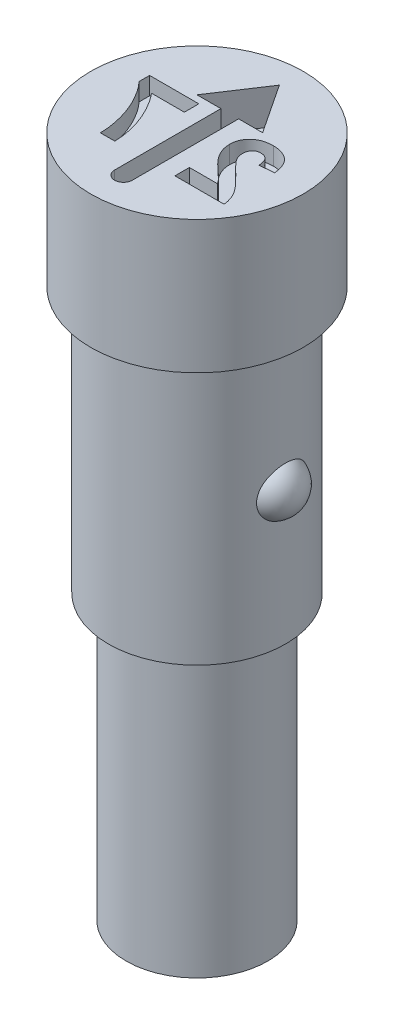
ISO-10303-21;
HEADER;
FILE_DESCRIPTION(('STEP AP214'),'2;1');
FILE_NAME('part.step','',(''),(''),'','','');
FILE_SCHEMA(('AUTOMOTIVE_DESIGN { 1 0 10303 214 1 1 1 1 }'));
ENDSEC;
DATA;
#1=APPLICATION_CONTEXT('core data for automotive mechanical design processes');
#2=APPLICATION_PROTOCOL_DEFINITION('international standard','automotive_design',2000,#1);
#3=PRODUCT_CONTEXT('',#1,'mechanical');
#4=PRODUCT('Part','Part','',(#3));
#5=PRODUCT_RELATED_PRODUCT_CATEGORY('part','',(#4));
#6=PRODUCT_DEFINITION_FORMATION('','',#4);
#7=PRODUCT_DEFINITION_CONTEXT('part definition',#1,'design');
#8=PRODUCT_DEFINITION('design','',#6,#7);
#9=PRODUCT_DEFINITION_SHAPE('','',#8);
#10=(LENGTH_UNIT() NAMED_UNIT(*) SI_UNIT(.MILLI.,.METRE.));
#11=(NAMED_UNIT(*) PLANE_ANGLE_UNIT() SI_UNIT($,.RADIAN.));
#12=(NAMED_UNIT(*) SI_UNIT($,.STERADIAN.) SOLID_ANGLE_UNIT());
#13=UNCERTAINTY_MEASURE_WITH_UNIT(LENGTH_MEASURE(1.E-05),#10,'distance_accuracy_value','');
#14=(GEOMETRIC_REPRESENTATION_CONTEXT(3) GLOBAL_UNCERTAINTY_ASSIGNED_CONTEXT((#13)) GLOBAL_UNIT_ASSIGNED_CONTEXT((#10,
#11,#12)) REPRESENTATION_CONTEXT('',''));
#15=CARTESIAN_POINT('',(0.,0.,0.));
#16=DIRECTION('',(0.,0.,1.));
#17=DIRECTION('',(1.,0.,0.));
#18=AXIS2_PLACEMENT_3D('',#15,#16,#17);
#19=CARTESIAN_POINT('',(0.,0.,0.));
#20=DIRECTION('',(0.,1.,0.));
#21=DIRECTION('',(0.,0.,1.));
#22=AXIS2_PLACEMENT_3D('',#19,#20,#21);
#23=CYLINDRICAL_SURFACE('',#22,1.);
#24=CARTESIAN_POINT('',(0.,-1.5,0.));
#25=DIRECTION('',(0.,1.,0.));
#26=DIRECTION('',(0.,0.,1.));
#27=AXIS2_PLACEMENT_3D('',#24,#25,#26);
#28=CIRCLE('',#27,1.);
#29=CARTESIAN_POINT('',(0.,-1.5,1.));
#30=VERTEX_POINT('',#29);
#31=EDGE_CURVE('E416',#30,#30,#28,.T.);
#32=ORIENTED_EDGE('',*,*,#31,.F.);
#33=EDGE_LOOP('',(#32));
#34=FACE_BOUND('',#33,.T.);
#35=CARTESIAN_POINT('',(0.,-4.5,0.));
#36=DIRECTION('',(0.,1.,0.));
#37=DIRECTION('',(0.,0.,1.));
#38=AXIS2_PLACEMENT_3D('',#35,#36,#37);
#39=CIRCLE('',#38,0.999999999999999);
#40=CARTESIAN_POINT('',(0.,-4.5,0.999999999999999));
#41=VERTEX_POINT('',#40);
#42=EDGE_CURVE('E413',#41,#41,#39,.T.);
#43=ORIENTED_EDGE('',*,*,#42,.T.);
#44=EDGE_LOOP('',(#43));
#45=FACE_BOUND('',#44,.T.);
#46=CARTESIAN_POINT('',(0.958208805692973,-3.,-0.286069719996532));
#47=CARTESIAN_POINT('',(0.95820899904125,-3.01437368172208,-0.286069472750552));
#48=CARTESIAN_POINT('',(0.958569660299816,-3.02875009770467,-0.284869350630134));
#49=CARTESIAN_POINT('',(0.959969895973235,-3.05707616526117,-0.280113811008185));
#50=CARTESIAN_POINT('',(0.961009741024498,-3.07102564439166,-0.276557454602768));
#51=CARTESIAN_POINT('',(0.963645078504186,-3.09807418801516,-0.267229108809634));
#52=CARTESIAN_POINT('',(0.965239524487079,-3.11117479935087,-0.261461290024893));
#53=CARTESIAN_POINT('',(0.968809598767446,-3.1362241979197,-0.247904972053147));
#54=CARTESIAN_POINT('',(0.97078525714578,-3.14817289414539,-0.240116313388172));
#55=CARTESIAN_POINT('',(0.974972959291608,-3.1709720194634,-0.222512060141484));
#56=CARTESIAN_POINT('',(0.977190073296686,-3.18178232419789,-0.212645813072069));
#57=CARTESIAN_POINT('',(0.981589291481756,-3.20169538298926,-0.191313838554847));
#58=CARTESIAN_POINT('',(0.983771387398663,-3.21079773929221,-0.179847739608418));
#59=CARTESIAN_POINT('',(0.98802322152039,-3.22765035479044,-0.154855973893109));
#60=CARTESIAN_POINT('',(0.990077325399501,-3.23527998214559,-0.141246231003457));
#61=CARTESIAN_POINT('',(0.993704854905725,-3.24830068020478,-0.112935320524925));
#62=CARTESIAN_POINT('',(0.995278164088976,-3.25369120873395,-0.0982338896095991));
#63=CARTESIAN_POINT('',(0.997845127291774,-3.26232929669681,-0.0674765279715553));
#64=CARTESIAN_POINT('',(0.99881096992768,-3.26547482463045,-0.0513895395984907));
#65=CARTESIAN_POINT('',(0.999953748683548,-3.26918472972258,-0.0188927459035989));
#66=CARTESIAN_POINT('',(1.00013059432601,-3.26974881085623,-0.00248290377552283));
#67=CARTESIAN_POINT('',(0.999673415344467,-3.26827409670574,0.0304827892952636));
#68=CARTESIAN_POINT('',(0.999025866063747,-3.26619188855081,0.0470365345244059));
#69=CARTESIAN_POINT('',(0.996964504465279,-3.25938391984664,0.0795432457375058));
#70=CARTESIAN_POINT('',(0.995550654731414,-3.25465803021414,0.0954961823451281));
#71=CARTESIAN_POINT('',(0.992111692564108,-3.24265466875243,0.126310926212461));
#72=CARTESIAN_POINT('',(0.990087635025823,-3.23538159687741,0.141174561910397));
#73=CARTESIAN_POINT('',(0.985652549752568,-3.21841700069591,0.169390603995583));
#74=CARTESIAN_POINT('',(0.983241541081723,-3.20872559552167,0.182743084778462));
#75=CARTESIAN_POINT('',(0.978373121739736,-3.18737757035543,0.207215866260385));
#76=CARTESIAN_POINT('',(0.975918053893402,-3.17577127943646,0.21838044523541));
#77=CARTESIAN_POINT('',(0.971206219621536,-3.15071840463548,0.238464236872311));
#78=CARTESIAN_POINT('',(0.96894938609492,-3.1372724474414,0.247384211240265));
#79=CARTESIAN_POINT('',(0.965035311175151,-3.10967534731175,0.262226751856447));
#80=CARTESIAN_POINT('',(0.963352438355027,-3.09560049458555,0.268284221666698));
#81=CARTESIAN_POINT('',(0.960639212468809,-3.06654950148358,0.277844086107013));
#82=CARTESIAN_POINT('',(0.959608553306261,-3.05157378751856,0.281347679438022));
#83=CARTESIAN_POINT('',(0.958375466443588,-3.02217276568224,0.285518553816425));
#84=CARTESIAN_POINT('',(0.958124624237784,-3.00777284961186,0.286351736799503));
#85=CARTESIAN_POINT('',(0.958343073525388,-2.97904115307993,0.285619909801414));
#86=CARTESIAN_POINT('',(0.95881223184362,-2.9647093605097,0.284055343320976));
#87=CARTESIAN_POINT('',(0.960392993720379,-2.9369184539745,0.278662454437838));
#88=CARTESIAN_POINT('',(0.961487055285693,-2.9234462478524,0.274895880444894));
#89=CARTESIAN_POINT('',(0.96418430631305,-2.89732319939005,0.265279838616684));
#90=CARTESIAN_POINT('',(0.965787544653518,-2.88467243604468,0.259430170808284));
#91=CARTESIAN_POINT('',(0.969389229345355,-2.86013951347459,0.245635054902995));
#92=CARTESIAN_POINT('',(0.971397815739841,-2.84829041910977,0.237633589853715));
#93=CARTESIAN_POINT('',(0.975573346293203,-2.82603489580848,0.219863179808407));
#94=CARTESIAN_POINT('',(0.977740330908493,-2.81562883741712,0.210093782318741));
#95=CARTESIAN_POINT('',(0.982155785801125,-2.79587119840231,0.188412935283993));
#96=CARTESIAN_POINT('',(0.984401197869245,-2.7866222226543,0.176407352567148));
#97=CARTESIAN_POINT('',(0.98861092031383,-2.77013639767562,0.151042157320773));
#98=CARTESIAN_POINT('',(0.990575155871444,-2.76290008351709,0.137682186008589));
#99=CARTESIAN_POINT('',(0.994128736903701,-2.75022207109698,0.109200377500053));
#100=CARTESIAN_POINT('',(0.995691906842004,-2.74489927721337,0.0940222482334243));
#101=CARTESIAN_POINT('',(0.998137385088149,-2.73671097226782,0.0629642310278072));
#102=CARTESIAN_POINT('',(0.999019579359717,-2.73384587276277,0.0470842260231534));
#103=CARTESIAN_POINT('',(1.00002899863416,-2.73057384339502,0.0146002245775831));
#104=CARTESIAN_POINT('',(1.00013450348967,-2.73023762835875,-0.00201161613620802));
#105=CARTESIAN_POINT('',(0.999521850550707,-2.73221602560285,-0.0350621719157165));
#106=CARTESIAN_POINT('',(0.998803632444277,-2.73453083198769,-0.0515008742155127));
#107=CARTESIAN_POINT('',(0.996612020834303,-2.74179479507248,-0.083837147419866));
#108=CARTESIAN_POINT('',(0.9951341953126,-2.74675941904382,-0.0997309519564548));
#109=CARTESIAN_POINT('',(0.991580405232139,-2.75924675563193,-0.130410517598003));
#110=CARTESIAN_POINT('',(0.989504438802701,-2.76676947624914,-0.145196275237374));
#111=CARTESIAN_POINT('',(0.985014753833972,-2.78412628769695,-0.173039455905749));
#112=CARTESIAN_POINT('',(0.98260535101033,-2.79393179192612,-0.186115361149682));
#113=CARTESIAN_POINT('',(0.977710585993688,-2.81569757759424,-0.210320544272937));
#114=CARTESIAN_POINT('',(0.975225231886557,-2.82765763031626,-0.221450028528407));
#115=CARTESIAN_POINT('',(0.970582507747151,-2.85292797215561,-0.24097009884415));
#116=CARTESIAN_POINT('',(0.96841606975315,-2.86616643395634,-0.249451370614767));
#117=CARTESIAN_POINT('',(0.964571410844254,-2.89399848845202,-0.263928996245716));
#118=CARTESIAN_POINT('',(0.962892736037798,-2.90859080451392,-0.269927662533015));
#119=CARTESIAN_POINT('',(0.960484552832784,-2.93595137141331,-0.278361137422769));
#120=CARTESIAN_POINT('',(0.959638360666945,-2.94857293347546,-0.281243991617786));
#121=CARTESIAN_POINT('',(0.958500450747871,-2.97412896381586,-0.285098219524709));
#122=CARTESIAN_POINT('',(0.958208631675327,-2.98706337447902,-0.286069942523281));
#123=CARTESIAN_POINT('',(0.958208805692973,-3.,-0.286069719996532));
#124=B_SPLINE_CURVE_WITH_KNOTS('',3,(#46,#47,#48,#49,#50,#51,#52,#53,#54,#55,#56,#57,#58,#59,
#60,#61,#62,#63,#64,#65,#66,#67,#68,#69,#70,#71,#72,#73,#74,#75,#76,#77,#78,#79,#80,#81,#82,#83,
#84,#85,#86,#87,#88,#89,#90,#91,#92,#93,#94,#95,#96,#97,#98,#99,#100,#101,#102,#103,#104,#105,
#106,#107,#108,#109,#110,#111,#112,#113,#114,#115,#116,#117,#118,#119,#120,#121,#122,#123),
.UNSPECIFIED.,.T.,.F.,(4,2,2,2,2,2,2,2,2,2,2,2,2,2,2,2,2,2,2,2,2,2,2,2,2,2,2,2,2,2,2,2,2,2,2,2,
2,2,4),(0.,0.0430722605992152,0.0861616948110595,0.129170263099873,0.172182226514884,
0.216398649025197,0.260625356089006,0.307626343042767,0.354638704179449,0.403671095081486,
0.452709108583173,0.502562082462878,0.552417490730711,0.60218720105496,0.65195446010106,
0.700577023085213,0.749183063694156,0.795186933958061,0.841169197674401,0.884233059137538,
0.927288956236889,0.969191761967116,1.01109859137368,1.05422451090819,1.0973614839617,
1.14312165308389,1.18889397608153,1.23715387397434,1.28542185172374,1.3350346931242,
1.38465116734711,1.43456047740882,1.48446994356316,1.53378516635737,1.58309515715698,
1.63046100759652,1.67778263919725,1.71655569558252,1.75532166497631),.UNSPECIFIED.);
#125=CARTESIAN_POINT('',(0.958208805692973,-3.,-0.286069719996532));
#126=VERTEX_POINT('',#125);
#127=EDGE_CURVE('E41',#126,#126,#124,.T.);
#128=ORIENTED_EDGE('',*,*,#127,.T.);
#129=EDGE_LOOP('',(#128));
#130=FACE_BOUND('',#129,.T.);
#131=ADVANCED_FACE('F37',(#34,#45,#130),#23,.T.);
#132=CARTESIAN_POINT('',(0.,0.,0.));
#133=DIRECTION('',(0.,1.,0.));
#134=DIRECTION('',(0.,0.,1.));
#135=AXIS2_PLACEMENT_3D('',#132,#133,#134);
#136=PLANE('',#135);
#137=DIRECTION('',(-1.,0.,0.));
#138=VECTOR('',#137,1.);
#139=CARTESIAN_POINT('',(0.613104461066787,0.,0.383307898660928));
#140=LINE('',#139,#138);
#141=CARTESIAN_POINT('',(0.613104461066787,0.,0.383307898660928));
#142=VERTEX_POINT('',#141);
#143=CARTESIAN_POINT('',(0.297249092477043,0.,0.383307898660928));
#144=VERTEX_POINT('',#143);
#145=EDGE_CURVE('E58',#142,#144,#140,.T.);
#146=ORIENTED_EDGE('',*,*,#145,.F.);
#147=CARTESIAN_POINT('',(0.379660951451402,0.,0.141180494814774));
#148=CARTESIAN_POINT('',(0.382246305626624,0.,0.144436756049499));
#149=CARTESIAN_POINT('',(0.387783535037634,0.,0.151410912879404));
#150=CARTESIAN_POINT('',(0.397203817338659,0.,0.162104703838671));
#151=CARTESIAN_POINT('',(0.40812111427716,0.,0.173785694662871));
#152=CARTESIAN_POINT('',(0.420381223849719,0.,0.186672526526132));
#153=CARTESIAN_POINT('',(0.434389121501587,0.,0.200308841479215));
#154=CARTESIAN_POINT('',(0.449640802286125,0.,0.215264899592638));
#155=CARTESIAN_POINT('',(0.466807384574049,0.,0.23077564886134));
#156=CARTESIAN_POINT('',(0.484587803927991,0.,0.247228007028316));
#157=CARTESIAN_POINT('',(0.502445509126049,0.,0.263240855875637));
#158=CARTESIAN_POINT('',(0.518859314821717,0.,0.278449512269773));
#159=CARTESIAN_POINT('',(0.533768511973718,0.,0.291905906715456));
#160=CARTESIAN_POINT('',(0.546478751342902,0.,0.304352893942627));
#161=CARTESIAN_POINT('',(0.557737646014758,0.,0.314940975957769));
#162=CARTESIAN_POINT('',(0.567139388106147,0.,0.324213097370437));
#163=CARTESIAN_POINT('',(0.574859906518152,0.,0.331944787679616));
#164=CARTESIAN_POINT('',(0.585498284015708,0.,0.343996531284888));
#165=CARTESIAN_POINT('',(0.599034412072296,0.,0.360296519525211));
#166=CARTESIAN_POINT('',(0.608557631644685,0.,0.375871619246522));
#167=CARTESIAN_POINT('',(0.613104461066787,0.,0.383307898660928));
#168=B_SPLINE_CURVE_WITH_KNOTS('',3,(#147,#148,#149,#150,#151,#152,#153,#154,#155,#156,#157,
#158,#159,#160,#161,#162,#163,#164,#165,#166,#167),.UNSPECIFIED.,.F.,.F.,(4,1,1,1,1,1,1,1,1,1,1,
1,1,1,1,1,1,1,4),(0.,0.0369753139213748,0.0791925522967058,0.126700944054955,0.17918407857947,
0.237368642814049,0.300558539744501,0.369153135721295,0.443112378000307,0.516018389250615,
0.582473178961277,0.642136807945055,0.694619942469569,0.740679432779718,0.779589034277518,
0.812073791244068,0.837814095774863,0.922564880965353,1.),.UNSPECIFIED.);
#169=CARTESIAN_POINT('',(0.379660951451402,0.,0.141180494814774));
#170=VERTEX_POINT('',#169);
#171=EDGE_CURVE('E243',#170,#142,#168,.T.);
#172=ORIENTED_EDGE('',*,*,#171,.F.);
#173=CARTESIAN_POINT('',(0.297249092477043,0.,-0.0720005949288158));
#174=CARTESIAN_POINT('',(0.297457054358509,0.,-0.0627352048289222));
#175=CARTESIAN_POINT('',(0.297869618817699,0.,-0.0443540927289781));
#176=CARTESIAN_POINT('',(0.301819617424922,0.,-0.0171813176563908));
#177=CARTESIAN_POINT('',(0.307854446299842,0.,0.00936485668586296));
#178=CARTESIAN_POINT('',(0.316773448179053,0.,0.0353493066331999));
#179=CARTESIAN_POINT('',(0.328078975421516,0.,0.0613953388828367));
#180=CARTESIAN_POINT('',(0.342652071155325,0.,0.0875614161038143));
#181=CARTESIAN_POINT('',(0.359572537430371,0.,0.114636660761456));
#182=CARTESIAN_POINT('',(0.37282059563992,0.,0.132141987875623));
#183=CARTESIAN_POINT('',(0.379660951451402,0.,0.141180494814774));
#184=B_SPLINE_CURVE_WITH_KNOTS('',3,(#173,#174,#175,#176,#177,#178,#179,#180,#181,#182,#183),
.UNSPECIFIED.,.F.,.F.,(4,1,1,1,1,1,1,1,4),(0.,0.119176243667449,0.236427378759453,
0.352663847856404,0.469086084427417,0.589462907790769,0.717601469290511,0.854189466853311,1.),.UNSPECIFIED.);
#185=CARTESIAN_POINT('',(0.297249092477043,0.,-0.0720005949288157));
#186=VERTEX_POINT('',#185);
#187=EDGE_CURVE('E246',#186,#170,#184,.T.);
#188=ORIENTED_EDGE('',*,*,#187,.F.);
#189=CARTESIAN_POINT('',(0.558106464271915,0.,-0.303230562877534));
#190=CARTESIAN_POINT('',(0.548223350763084,0.,-0.303040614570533));
#191=CARTESIAN_POINT('',(0.528974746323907,0.,-0.302670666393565));
#192=CARTESIAN_POINT('',(0.500875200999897,0.,-0.299615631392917));
#193=CARTESIAN_POINT('',(0.474477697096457,0.,-0.294288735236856));
#194=CARTESIAN_POINT('',(0.449551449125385,0.,-0.287232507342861));
#195=CARTESIAN_POINT('',(0.426352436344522,0.,-0.277811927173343));
#196=CARTESIAN_POINT('',(0.404687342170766,0.,-0.266422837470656));
#197=CARTESIAN_POINT('',(0.384897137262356,0.,-0.25263299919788));
#198=CARTESIAN_POINT('',(0.366686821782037,0.,-0.23719443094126));
#199=CARTESIAN_POINT('',(0.350408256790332,0.,-0.220217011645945));
#200=CARTESIAN_POINT('',(0.336149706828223,0.,-0.202107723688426));
#201=CARTESIAN_POINT('',(0.324203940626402,0.,-0.182879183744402));
#202=CARTESIAN_POINT('',(0.314179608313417,0.,-0.162765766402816));
#203=CARTESIAN_POINT('',(0.306736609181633,0.,-0.141443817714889));
#204=CARTESIAN_POINT('',(0.30131331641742,0.,-0.119208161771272));
#205=CARTESIAN_POINT('',(0.297717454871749,0.,-0.095955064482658));
#206=CARTESIAN_POINT('',(0.29740693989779,0.,-0.0800737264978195));
#207=CARTESIAN_POINT('',(0.297249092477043,0.,-0.0720005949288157));
#208=B_SPLINE_CURVE_WITH_KNOTS('',3,(#189,#190,#191,#192,#193,#194,#195,#196,#197,#198,#199,
#200,#201,#202,#203,#204,#205,#206,#207),.UNSPECIFIED.,.F.,.F.,(4,1,1,1,1,1,1,1,1,1,1,1,1,1,1,1,
4),(0.,0.0756723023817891,0.147381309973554,0.216084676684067,0.28169803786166,
0.345459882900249,0.407485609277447,0.46873129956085,0.529782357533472,0.590032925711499,
0.648548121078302,0.70595351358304,0.763101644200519,0.820289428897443,0.878479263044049,
0.938226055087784,1.),.UNSPECIFIED.);
#209=CARTESIAN_POINT('',(0.558106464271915,0.,-0.303230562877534));
#210=VERTEX_POINT('',#209);
#211=EDGE_CURVE('E552',#210,#186,#208,.T.);
#212=ORIENTED_EDGE('',*,*,#211,.F.);
#213=CARTESIAN_POINT('',(0.831223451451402,0.,-0.0468002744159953));
#214=CARTESIAN_POINT('',(0.829909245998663,0.,-0.0578359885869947));
#215=CARTESIAN_POINT('',(0.827361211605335,0.,-0.0792324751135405));
#216=CARTESIAN_POINT('',(0.821002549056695,0.,-0.109965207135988));
#217=CARTESIAN_POINT('',(0.81294953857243,0.,-0.138317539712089));
#218=CARTESIAN_POINT('',(0.802818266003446,0.,-0.164236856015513));
#219=CARTESIAN_POINT('',(0.791027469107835,0.,-0.187887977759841));
#220=CARTESIAN_POINT('',(0.776975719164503,0.,-0.208916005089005));
#221=CARTESIAN_POINT('',(0.76115399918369,0.,-0.227553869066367));
#222=CARTESIAN_POINT('',(0.743548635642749,0.,-0.243791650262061));
#223=CARTESIAN_POINT('',(0.724271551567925,0.,-0.257681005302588));
#224=CARTESIAN_POINT('',(0.704043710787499,0.,-0.270079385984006));
#225=CARTESIAN_POINT('',(0.682469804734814,0.,-0.280249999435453));
#226=CARTESIAN_POINT('',(0.65978736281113,0.,-0.288632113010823));
#227=CARTESIAN_POINT('',(0.63600663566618,0.,-0.295331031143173));
#228=CARTESIAN_POINT('',(0.611017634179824,0.,-0.299760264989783));
#229=CARTESIAN_POINT('',(0.584974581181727,0.,-0.302875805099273));
#230=CARTESIAN_POINT('',(0.567197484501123,0.,-0.30311052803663));
#231=CARTESIAN_POINT('',(0.558106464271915,0.,-0.303230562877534));
#232=B_SPLINE_CURVE_WITH_KNOTS('',3,(#213,#214,#215,#216,#217,#218,#219,#220,#221,#222,#223,
#224,#225,#226,#227,#228,#229,#230,#231),.UNSPECIFIED.,.F.,.F.,(4,1,1,1,1,1,1,1,1,1,1,1,1,1,1,1,
4),(0.,0.0794357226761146,0.154013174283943,0.224141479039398,0.289934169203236,
0.352732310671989,0.41272577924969,0.470302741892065,0.527168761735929,0.583502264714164,
0.639948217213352,0.696584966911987,0.753726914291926,0.812707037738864,0.872963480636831,
0.93503486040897,1.),.UNSPECIFIED.);
#233=CARTESIAN_POINT('',(0.831223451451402,0.,-0.0468002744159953));
#234=VERTEX_POINT('',#233);
#235=EDGE_CURVE('E560',#234,#210,#232,.T.);
#236=ORIENTED_EDGE('',*,*,#235,.F.);
#237=DIRECTION('',(0.995240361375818,0.,-0.0974506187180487));
#238=VECTOR('',#237,1.);
#239=CARTESIAN_POINT('',(0.667761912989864,0.,-0.0307946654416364));
#240=LINE('',#239,#238);
#241=CARTESIAN_POINT('',(0.667761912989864,0.,-0.0307946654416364));
#242=VERTEX_POINT('',#241);
#243=EDGE_CURVE('E568',#242,#234,#240,.T.);
#244=ORIENTED_EDGE('',*,*,#243,.F.);
#245=CARTESIAN_POINT('',(0.561511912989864,0.,-0.161563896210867));
#246=CARTESIAN_POINT('',(0.568925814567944,0.,-0.161228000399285));
#247=CARTESIAN_POINT('',(0.583247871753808,0.,-0.160579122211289));
#248=CARTESIAN_POINT('',(0.603602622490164,0.,-0.154910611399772));
#249=CARTESIAN_POINT('',(0.621409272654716,0.,-0.145097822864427));
#250=CARTESIAN_POINT('',(0.634099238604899,0.,-0.133915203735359));
#251=CARTESIAN_POINT('',(0.642671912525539,0.,-0.123040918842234));
#252=CARTESIAN_POINT('',(0.64851303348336,0.,-0.113564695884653));
#253=CARTESIAN_POINT('',(0.653547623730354,0.,-0.102796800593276));
#254=CARTESIAN_POINT('',(0.658008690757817,0.,-0.090858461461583));
#255=CARTESIAN_POINT('',(0.661532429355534,0.,-0.0776129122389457));
#256=CARTESIAN_POINT('',(0.664370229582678,0.,-0.0631610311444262));
#257=CARTESIAN_POINT('',(0.666657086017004,0.,-0.0474250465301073));
#258=CARTESIAN_POINT('',(0.667384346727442,0.,-0.0364779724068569));
#259=CARTESIAN_POINT('',(0.667761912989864,0.,-0.0307946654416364));
#260=B_SPLINE_CURVE_WITH_KNOTS('',3,(#245,#246,#247,#248,#249,#250,#251,#252,#253,#254,#255,
#256,#257,#258,#259),.UNSPECIFIED.,.F.,.F.,(4,1,1,1,1,1,1,1,1,1,1,1,4),(0.,0.116899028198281,
0.225823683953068,0.330086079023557,0.435451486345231,0.490306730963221,0.548244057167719,
0.610766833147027,0.677675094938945,0.749188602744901,0.826858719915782,0.910111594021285,1.),.UNSPECIFIED.);
#261=CARTESIAN_POINT('',(0.561511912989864,0.,-0.161563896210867));
#262=VERTEX_POINT('',#261);
#263=EDGE_CURVE('E574',#262,#242,#260,.T.);
#264=ORIENTED_EDGE('',*,*,#263,.F.);
#265=CARTESIAN_POINT('',(0.460710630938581,0.,-0.0500354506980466));
#266=CARTESIAN_POINT('',(0.461016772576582,0.,-0.0585162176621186));
#267=CARTESIAN_POINT('',(0.461595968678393,0.,-0.0745611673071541));
#268=CARTESIAN_POINT('',(0.466452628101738,0.,-0.0972035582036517));
#269=CARTESIAN_POINT('',(0.475065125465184,0.,-0.1166679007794));
#270=CARTESIAN_POINT('',(0.48692294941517,0.,-0.133013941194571));
#271=CARTESIAN_POINT('',(0.501917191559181,0.,-0.145821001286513));
#272=CARTESIAN_POINT('',(0.519445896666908,0.,-0.155284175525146));
#273=CARTESIAN_POINT('',(0.539765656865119,0.,-0.1605160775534));
#274=CARTESIAN_POINT('',(0.554047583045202,0.,-0.161204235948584));
#275=CARTESIAN_POINT('',(0.561511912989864,0.,-0.161563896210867));
#276=B_SPLINE_CURVE_WITH_KNOTS('',3,(#265,#266,#267,#268,#269,#270,#271,#272,#273,#274,#275),
.UNSPECIFIED.,.F.,.F.,(4,1,1,1,1,1,1,1,4),(0.,0.149140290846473,0.282161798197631,
0.404655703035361,0.521109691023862,0.63441645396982,0.748796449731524,0.868710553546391,1.),.UNSPECIFIED.);
#277=CARTESIAN_POINT('',(0.460710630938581,0.,-0.0500354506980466));
#278=VERTEX_POINT('',#277);
#279=EDGE_CURVE('E579',#278,#262,#276,.T.);
#280=ORIENTED_EDGE('',*,*,#279,.F.);
#281=CARTESIAN_POINT('',(0.493062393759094,0.,0.0482117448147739));
#282=CARTESIAN_POINT('',(0.488140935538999,0.,0.0400366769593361));
#283=CARTESIAN_POINT('',(0.478648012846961,0.,0.0242679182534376));
#284=CARTESIAN_POINT('',(0.468238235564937,0.,-0.000528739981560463));
#285=CARTESIAN_POINT('',(0.46198989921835,0.,-0.0253202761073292));
#286=CARTESIAN_POINT('',(0.461132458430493,0.,-0.0418858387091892));
#287=CARTESIAN_POINT('',(0.460710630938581,0.,-0.0500354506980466));
#288=B_SPLINE_CURVE_WITH_KNOTS('',3,(#281,#282,#283,#284,#285,#286,#287),.UNSPECIFIED.,.F.,.F.,
(4,1,1,1,4),(0.,0.272795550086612,0.526191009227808,0.766904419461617,1.),.UNSPECIFIED.);
#289=CARTESIAN_POINT('',(0.493062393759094,0.,0.0482117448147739));
#290=VERTEX_POINT('',#289);
#291=EDGE_CURVE('E587',#290,#278,#288,.T.);
#292=ORIENTED_EDGE('',*,*,#291,.F.);
#293=CARTESIAN_POINT('',(0.623150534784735,0.,0.185451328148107));
#294=CARTESIAN_POINT('',(0.614746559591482,0.,0.177339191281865));
#295=CARTESIAN_POINT('',(0.598747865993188,0.,0.161896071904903));
#296=CARTESIAN_POINT('',(0.575965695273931,0.,0.139782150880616));
#297=CARTESIAN_POINT('',(0.555937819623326,0.,0.119453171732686));
#298=CARTESIAN_POINT('',(0.538245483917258,0.,0.101435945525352));
#299=CARTESIAN_POINT('',(0.523297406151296,0.,0.0852717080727));
#300=CARTESIAN_POINT('',(0.510896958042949,0.,0.0712143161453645));
#301=CARTESIAN_POINT('',(0.500887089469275,0.,0.0592065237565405));
#302=CARTESIAN_POINT('',(0.495465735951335,0.,0.0515887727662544));
#303=CARTESIAN_POINT('',(0.493062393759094,0.,0.0482117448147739));
#304=B_SPLINE_CURVE_WITH_KNOTS('',3,(#293,#294,#295,#296,#297,#298,#299,#300,#301,#302,#303),
.UNSPECIFIED.,.F.,.F.,(4,1,1,1,1,1,1,1,4),(0.,0.185090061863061,0.352356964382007,
0.503079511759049,0.637279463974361,0.752473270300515,0.851885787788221,0.934339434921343,1.),.UNSPECIFIED.);
#305=CARTESIAN_POINT('',(0.623150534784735,0.,0.185451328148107));
#306=VERTEX_POINT('',#305);
#307=EDGE_CURVE('E595',#306,#290,#304,.T.);
#308=ORIENTED_EDGE('',*,*,#307,.F.);
#309=CARTESIAN_POINT('',(0.853018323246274,0.,0.546769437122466));
#310=CARTESIAN_POINT('',(0.851136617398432,0.,0.532799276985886));
#311=CARTESIAN_POINT('',(0.84737426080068,0.,0.504866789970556));
#312=CARTESIAN_POINT('',(0.835742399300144,0.,0.464064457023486));
#313=CARTESIAN_POINT('',(0.820217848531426,0.,0.424248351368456));
#314=CARTESIAN_POINT('',(0.80336889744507,0.,0.39184770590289));
#315=CARTESIAN_POINT('',(0.786610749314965,0.,0.365766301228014));
#316=CARTESIAN_POINT('',(0.771406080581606,0.,0.344394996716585));
#317=CARTESIAN_POINT('',(0.753267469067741,0.,0.321656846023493));
#318=CARTESIAN_POINT('',(0.732458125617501,0.,0.29736828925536));
#319=CARTESIAN_POINT('',(0.709093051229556,0.,0.271453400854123));
#320=CARTESIAN_POINT('',(0.682997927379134,0.,0.244008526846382));
#321=CARTESIAN_POINT('',(0.654048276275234,0.,0.215165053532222));
#322=CARTESIAN_POINT('',(0.633681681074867,0.,0.195578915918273));
#323=CARTESIAN_POINT('',(0.623150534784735,0.,0.185451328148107));
#324=B_SPLINE_CURVE_WITH_KNOTS('',3,(#309,#310,#311,#312,#313,#314,#315,#316,#317,#318,#319,
#320,#321,#322,#323),.UNSPECIFIED.,.F.,.F.,(4,1,1,1,1,1,1,1,1,1,1,1,4),(0.,0.0963574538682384,
0.192660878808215,0.289454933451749,0.388479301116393,0.441921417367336,0.501521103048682,
0.567882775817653,0.640891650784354,0.72037065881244,0.806636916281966,0.900015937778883,1.),.UNSPECIFIED.);
#325=CARTESIAN_POINT('',(0.853018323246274,0.,0.546769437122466));
#326=VERTEX_POINT('',#325);
#327=EDGE_CURVE('E603',#326,#306,#324,.T.);
#328=ORIENTED_EDGE('',*,*,#327,.F.);
#329=DIRECTION('',(1.,0.,0.));
#330=VECTOR('',#329,1.);
#331=CARTESIAN_POINT('',(0.297249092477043,0.,0.546769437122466));
#332=LINE('',#331,#330);
#333=CARTESIAN_POINT('',(0.297249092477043,0.,0.546769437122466));
#334=VERTEX_POINT('',#333);
#335=EDGE_CURVE('E611',#334,#326,#332,.T.);
#336=ORIENTED_EDGE('',*,*,#335,.F.);
#337=DIRECTION('',(0.,0.,1.));
#338=VECTOR('',#337,1.);
#339=CARTESIAN_POINT('',(0.297249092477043,0.,0.383307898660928));
#340=LINE('',#339,#338);
#341=EDGE_CURVE('E617',#144,#334,#340,.T.);
#342=ORIENTED_EDGE('',*,*,#341,.F.);
#343=EDGE_LOOP('',(#146,#172,#188,#212,#236,#244,#264,#280,#292,#308,#328,#336,#342));
#344=FACE_BOUND('',#343,.T.);
#345=DIRECTION('',(1.,0.,0.));
#346=VECTOR('',#345,1.);
#347=CARTESIAN_POINT('',(-0.642280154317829,0.,-0.128871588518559));
#348=LINE('',#347,#346);
#349=CARTESIAN_POINT('',(-0.642280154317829,0.,-0.128871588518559));
#350=VERTEX_POINT('',#349);
#351=CARTESIAN_POINT('',(-0.27159706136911,0.,-0.128871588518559));
#352=VERTEX_POINT('',#351);
#353=EDGE_CURVE('E66',#350,#352,#348,.T.);
#354=ORIENTED_EDGE('',*,*,#353,.F.);
#355=CARTESIAN_POINT('',(-0.38057142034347,0.,0.546769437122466));
#356=CARTESIAN_POINT('',(-0.381117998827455,0.,0.532288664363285));
#357=CARTESIAN_POINT('',(-0.382217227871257,0.,0.503166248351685));
#358=CARTESIAN_POINT('',(-0.386329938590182,0.,0.45945445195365));
#359=CARTESIAN_POINT('',(-0.392789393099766,0.,0.415579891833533));
#360=CARTESIAN_POINT('',(-0.400812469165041,0.,0.371441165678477));
#361=CARTESIAN_POINT('',(-0.411404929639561,0.,0.327145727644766));
#362=CARTESIAN_POINT('',(-0.423494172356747,0.,0.282529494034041));
#363=CARTESIAN_POINT('',(-0.438138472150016,0.,0.237830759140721));
#364=CARTESIAN_POINT('',(-0.454554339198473,0.,0.193134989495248));
#365=CARTESIAN_POINT('',(-0.472676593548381,0.,0.148866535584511));
#366=CARTESIAN_POINT('',(-0.492427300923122,0.,0.105574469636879));
#367=CARTESIAN_POINT('',(-0.513755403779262,0.,0.0635288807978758));
#368=CARTESIAN_POINT('',(-0.536383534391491,0.,0.0225820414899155));
#369=CARTESIAN_POINT('',(-0.560574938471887,0.,-0.017134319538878));
#370=CARTESIAN_POINT('',(-0.586347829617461,0.,-0.0555770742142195));
#371=CARTESIAN_POINT('',(-0.613336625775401,0.,-0.093024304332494));
#372=CARTESIAN_POINT('',(-0.632633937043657,0.,-0.116924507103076));
#373=CARTESIAN_POINT('',(-0.642280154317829,0.,-0.128871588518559));
#374=B_SPLINE_CURVE_WITH_KNOTS('',3,(#355,#356,#357,#358,#359,#360,#361,#362,#363,#364,#365,
#366,#367,#368,#369,#370,#371,#372,#373),.UNSPECIFIED.,.F.,.F.,(4,1,1,1,1,1,1,1,1,1,1,1,1,1,1,1,
4),(0.,0.0589531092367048,0.118561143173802,0.178522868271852,0.239353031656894,
0.301026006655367,0.363773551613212,0.427382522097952,0.492333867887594,0.557475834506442,
0.621960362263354,0.685889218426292,0.749254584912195,0.812267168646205,0.875035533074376,
0.937533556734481,1.),.UNSPECIFIED.);
#375=CARTESIAN_POINT('',(-0.38057142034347,0.,0.546769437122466));
#376=VERTEX_POINT('',#375);
#377=EDGE_CURVE('E328',#376,#350,#374,.T.);
#378=ORIENTED_EDGE('',*,*,#377,.F.);
#379=DIRECTION('',(1.,0.,0.));
#380=VECTOR('',#379,1.);
#381=CARTESIAN_POINT('',(-0.544032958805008,0.,0.546769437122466));
#382=LINE('',#381,#380);
#383=CARTESIAN_POINT('',(-0.544032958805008,0.,0.546769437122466));
#384=VERTEX_POINT('',#383);
#385=EDGE_CURVE('E322',#384,#376,#382,.T.);
#386=ORIENTED_EDGE('',*,*,#385,.F.);
#387=CARTESIAN_POINT('',(-0.827366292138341,0.,-0.172461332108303));
#388=CARTESIAN_POINT('',(-0.821568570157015,0.,-0.166562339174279));
#389=CARTESIAN_POINT('',(-0.809650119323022,0.,-0.154435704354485));
#390=CARTESIAN_POINT('',(-0.792578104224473,0.,-0.134589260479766));
#391=CARTESIAN_POINT('',(-0.775253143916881,0.,-0.113052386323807));
#392=CARTESIAN_POINT('',(-0.758037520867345,0.,-0.089534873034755));
#393=CARTESIAN_POINT('',(-0.740396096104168,0.,-0.0644082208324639));
#394=CARTESIAN_POINT('',(-0.723104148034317,0.,-0.0371907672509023));
#395=CARTESIAN_POINT('',(-0.705566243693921,0.,-0.00823560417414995));
#396=CARTESIAN_POINT('',(-0.681954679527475,0.,0.0327215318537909));
#397=CARTESIAN_POINT('',(-0.654355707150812,0.,0.0862242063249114));
#398=CARTESIAN_POINT('',(-0.625157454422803,0.,0.152730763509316));
#399=CARTESIAN_POINT('',(-0.600281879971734,0.,0.221279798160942));
#400=CARTESIAN_POINT('',(-0.583248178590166,0.,0.279688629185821));
#401=CARTESIAN_POINT('',(-0.571739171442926,0.,0.326503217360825));
#402=CARTESIAN_POINT('',(-0.564219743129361,0.,0.360735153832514));
#403=CARTESIAN_POINT('',(-0.557889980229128,0.,0.394003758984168));
#404=CARTESIAN_POINT('',(-0.552740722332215,0.,0.426367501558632));
#405=CARTESIAN_POINT('',(-0.548897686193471,0.,0.457841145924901));
#406=CARTESIAN_POINT('',(-0.545861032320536,0.,0.488315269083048));
#407=CARTESIAN_POINT('',(-0.544362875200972,0.,0.517864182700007));
#408=CARTESIAN_POINT('',(-0.544141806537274,0.,0.537232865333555));
#409=CARTESIAN_POINT('',(-0.544032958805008,0.,0.546769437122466));
#410=B_SPLINE_CURVE_WITH_KNOTS('',3,(#387,#388,#389,#390,#391,#392,#393,#394,#395,#396,#397,
#398,#399,#400,#401,#402,#403,#404,#405,#406,#407,#408,#409),.UNSPECIFIED.,.F.,.F.,(4,1,1,1,1,1,
1,1,1,1,1,1,1,1,1,1,1,1,1,1,4),(0.,0.0314272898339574,0.0646054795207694,0.0994393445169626,
0.136456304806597,0.175351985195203,0.216100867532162,0.258977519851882,0.304007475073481,
0.395756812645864,0.487615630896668,0.579873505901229,0.672707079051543,0.718694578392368,
0.76307923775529,0.805893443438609,0.847386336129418,0.88760014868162,0.926386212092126,
0.963754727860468,1.),.UNSPECIFIED.);
#411=CARTESIAN_POINT('',(-0.827366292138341,0.,-0.172461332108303));
#412=VERTEX_POINT('',#411);
#413=EDGE_CURVE('E317',#412,#384,#410,.T.);
#414=ORIENTED_EDGE('',*,*,#413,.F.);
#415=DIRECTION('',(0.,0.,1.));
#416=VECTOR('',#415,1.);
#417=CARTESIAN_POINT('',(-0.827366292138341,0.,-0.292333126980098));
#418=LINE('',#417,#416);
#419=CARTESIAN_POINT('',(-0.827366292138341,0.,-0.292333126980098));
#420=VERTEX_POINT('',#419);
#421=EDGE_CURVE('E314',#420,#412,#418,.T.);
#422=ORIENTED_EDGE('',*,*,#421,.F.);
#423=DIRECTION('',(-1.,0.,0.));
#424=VECTOR('',#423,1.);
#425=CARTESIAN_POINT('',(-0.27159706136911,0.,-0.292333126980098));
#426=LINE('',#425,#424);
#427=CARTESIAN_POINT('',(-0.27159706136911,0.,-0.292333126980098));
#428=VERTEX_POINT('',#427);
#429=EDGE_CURVE('E311',#428,#420,#426,.T.);
#430=ORIENTED_EDGE('',*,*,#429,.F.);
#431=DIRECTION('',(0.,0.,-1.));
#432=VECTOR('',#431,1.);
#433=CARTESIAN_POINT('',(-0.27159706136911,0.,-0.128871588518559));
#434=LINE('',#433,#432);
#435=EDGE_CURVE('E308',#352,#428,#434,.T.);
#436=ORIENTED_EDGE('',*,*,#435,.F.);
#437=EDGE_LOOP('',(#354,#378,#386,#414,#422,#430,#436));
#438=FACE_BOUND('',#437,.T.);
#439=DIRECTION('',(-0.551936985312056,0.,-0.833885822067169));
#440=VECTOR('',#439,1.);
#441=CARTESIAN_POINT('',(0.370655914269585,0.,-0.37));
#442=LINE('',#441,#440);
#443=CARTESIAN_POINT('',(0.370655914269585,0.,-0.37));
#444=VERTEX_POINT('',#443);
#445=CARTESIAN_POINT('',(0.,0.,-0.93));
#446=VERTEX_POINT('',#445);
#447=EDGE_CURVE('E373',#444,#446,#442,.T.);
#448=ORIENTED_EDGE('',*,*,#447,.F.);
#449=DIRECTION('',(1.,0.,0.));
#450=VECTOR('',#449,1.);
#451=CARTESIAN_POINT('',(0.1,0.,-0.37));
#452=LINE('',#451,#450);
#453=CARTESIAN_POINT('',(0.1,0.,-0.37));
#454=VERTEX_POINT('',#453);
#455=EDGE_CURVE('E354',#454,#444,#452,.T.);
#456=ORIENTED_EDGE('',*,*,#455,.F.);
#457=DIRECTION('',(0.,0.,-1.));
#458=VECTOR('',#457,1.);
#459=CARTESIAN_POINT('',(0.100000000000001,0.,0.83));
#460=LINE('',#459,#458);
#461=CARTESIAN_POINT('',(0.1,0.,0.83));
#462=VERTEX_POINT('',#461);
#463=EDGE_CURVE('E388',#462,#454,#460,.T.);
#464=ORIENTED_EDGE('',*,*,#463,.F.);
#465=CARTESIAN_POINT('',(0.,0.,0.83));
#466=DIRECTION('',(0.,1.,0.));
#467=DIRECTION('',(0.,0.,1.));
#468=AXIS2_PLACEMENT_3D('',#465,#466,#467);
#469=CIRCLE('',#468,0.1);
#470=CARTESIAN_POINT('',(-0.1,0.,0.83));
#471=VERTEX_POINT('',#470);
#472=EDGE_CURVE('E385',#471,#462,#469,.T.);
#473=ORIENTED_EDGE('',*,*,#472,.F.);
#474=DIRECTION('',(0.,0.,1.));
#475=VECTOR('',#474,1.);
#476=CARTESIAN_POINT('',(-0.1,0.,-0.37));
#477=LINE('',#476,#475);
#478=CARTESIAN_POINT('',(-0.1,0.,-0.37));
#479=VERTEX_POINT('',#478);
#480=EDGE_CURVE('E382',#479,#471,#477,.T.);
#481=ORIENTED_EDGE('',*,*,#480,.F.);
#482=DIRECTION('',(1.,0.,0.));
#483=VECTOR('',#482,1.);
#484=CARTESIAN_POINT('',(-0.370655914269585,0.,-0.37));
#485=LINE('',#484,#483);
#486=CARTESIAN_POINT('',(-0.370655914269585,0.,-0.37));
#487=VERTEX_POINT('',#486);
#488=EDGE_CURVE('E379',#487,#479,#485,.T.);
#489=ORIENTED_EDGE('',*,*,#488,.F.);
#490=DIRECTION('',(-0.551936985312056,0.,0.83388582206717));
#491=VECTOR('',#490,1.);
#492=CARTESIAN_POINT('',(0.,0.,-0.93));
#493=LINE('',#492,#491);
#494=EDGE_CURVE('E375',#446,#487,#493,.T.);
#495=ORIENTED_EDGE('',*,*,#494,.F.);
#496=EDGE_LOOP('',(#448,#456,#464,#473,#481,#489,#495));
#497=FACE_BOUND('',#496,.T.);
#498=CARTESIAN_POINT('',(0.,0.,0.));
#499=DIRECTION('',(0.,1.,0.));
#500=DIRECTION('',(0.,0.,1.));
#501=AXIS2_PLACEMENT_3D('',#498,#499,#500);
#502=CIRCLE('',#501,1.2);
#503=CARTESIAN_POINT('',(0.,0.,1.2));
#504=VERTEX_POINT('',#503);
#505=EDGE_CURVE('E11',#504,#504,#502,.T.);
#506=ORIENTED_EDGE('',*,*,#505,.T.);
#507=EDGE_LOOP('',(#506));
#508=FACE_BOUND('',#507,.T.);
#509=ADVANCED_FACE('F39',(#344,#438,#497,#508),#136,.T.);
#510=CARTESIAN_POINT('',(0.,0.,0.));
#511=DIRECTION('',(0.,1.,0.));
#512=DIRECTION('',(0.,0.,1.));
#513=AXIS2_PLACEMENT_3D('',#510,#511,#512);
#514=CYLINDRICAL_SURFACE('',#513,1.2);
#515=CARTESIAN_POINT('',(0.,-1.5,0.));
#516=DIRECTION('',(0.,1.,0.));
#517=DIRECTION('',(0.,0.,1.));
#518=AXIS2_PLACEMENT_3D('',#515,#516,#517);
#519=CIRCLE('',#518,1.2);
#520=CARTESIAN_POINT('',(0.,-1.5,1.2));
#521=VERTEX_POINT('',#520);
#522=EDGE_CURVE('E51',#521,#521,#519,.T.);
#523=ORIENTED_EDGE('',*,*,#522,.T.);
#524=EDGE_LOOP('',(#523));
#525=FACE_BOUND('',#524,.T.);
#526=ORIENTED_EDGE('',*,*,#505,.F.);
#527=EDGE_LOOP('',(#526));
#528=FACE_BOUND('',#527,.T.);
#529=ADVANCED_FACE('F422',(#525,#528),#514,.T.);
#530=CARTESIAN_POINT('',(-1.2,-1.5,0.));
#531=DIRECTION('',(0.,-1.,0.));
#532=DIRECTION('',(0.,0.,-1.));
#533=AXIS2_PLACEMENT_3D('',#530,#531,#532);
#534=PLANE('',#533);
#535=ORIENTED_EDGE('',*,*,#31,.T.);
#536=EDGE_LOOP('',(#535));
#537=FACE_BOUND('',#536,.T.);
#538=ORIENTED_EDGE('',*,*,#522,.F.);
#539=EDGE_LOOP('',(#538));
#540=FACE_BOUND('',#539,.T.);
#541=ADVANCED_FACE('F425',(#537,#540),#534,.T.);
#542=CARTESIAN_POINT('',(-0.999999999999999,-4.5,0.));
#543=DIRECTION('',(0.,-1.,0.));
#544=DIRECTION('',(0.,0.,-1.));
#545=AXIS2_PLACEMENT_3D('',#542,#543,#544);
#546=PLANE('',#545);
#547=CARTESIAN_POINT('',(0.,-4.5,0.));
#548=DIRECTION('',(0.,1.,0.));
#549=DIRECTION('',(0.,0.,1.));
#550=AXIS2_PLACEMENT_3D('',#547,#548,#549);
#551=CIRCLE('',#550,0.799999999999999);
#552=CARTESIAN_POINT('',(0.,-4.5,0.799999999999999));
#553=VERTEX_POINT('',#552);
#554=EDGE_CURVE('E410',#553,#553,#551,.T.);
#555=ORIENTED_EDGE('',*,*,#554,.T.);
#556=EDGE_LOOP('',(#555));
#557=FACE_BOUND('',#556,.T.);
#558=ORIENTED_EDGE('',*,*,#42,.F.);
#559=EDGE_LOOP('',(#558));
#560=FACE_BOUND('',#559,.T.);
#561=ADVANCED_FACE('F427',(#557,#560),#546,.T.);
#562=CARTESIAN_POINT('',(0.,0.,0.));
#563=DIRECTION('',(0.,1.,0.));
#564=DIRECTION('',(0.,0.,1.));
#565=AXIS2_PLACEMENT_3D('',#562,#563,#564);
#566=CYLINDRICAL_SURFACE('',#565,0.799999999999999);
#567=CARTESIAN_POINT('',(0.,-7.7,0.));
#568=DIRECTION('',(0.,1.,0.));
#569=DIRECTION('',(0.,0.,1.));
#570=AXIS2_PLACEMENT_3D('',#567,#568,#569);
#571=CIRCLE('',#570,0.799999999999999);
#572=CARTESIAN_POINT('',(0.,-7.7,0.799999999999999));
#573=VERTEX_POINT('',#572);
#574=EDGE_CURVE('E395',#573,#573,#571,.T.);
#575=ORIENTED_EDGE('',*,*,#574,.T.);
#576=EDGE_LOOP('',(#575));
#577=FACE_BOUND('',#576,.T.);
#578=ORIENTED_EDGE('',*,*,#554,.F.);
#579=EDGE_LOOP('',(#578));
#580=FACE_BOUND('',#579,.T.);
#581=ADVANCED_FACE('F434',(#577,#580),#566,.T.);
#582=CARTESIAN_POINT('',(-0.799999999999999,-7.7,0.));
#583=DIRECTION('',(0.,-1.,0.));
#584=DIRECTION('',(0.,0.,-1.));
#585=AXIS2_PLACEMENT_3D('',#582,#583,#584);
#586=PLANE('',#585);
#587=ORIENTED_EDGE('',*,*,#574,.F.);
#588=EDGE_LOOP('',(#587));
#589=FACE_BOUND('',#588,.T.);
#590=ADVANCED_FACE('F449',(#589),#586,.T.);
#591=CARTESIAN_POINT('',(0.370655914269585,-0.4,-0.37));
#592=DIRECTION('',(0.833885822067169,0.,-0.551936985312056));
#593=DIRECTION('',(-0.551936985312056,0.,-0.833885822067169));
#594=AXIS2_PLACEMENT_3D('',#591,#592,#593);
#595=PLANE('',#594);
#596=ORIENTED_EDGE('',*,*,#447,.T.);
#597=DIRECTION('',(0.,1.,0.));
#598=VECTOR('',#597,1.);
#599=CARTESIAN_POINT('',(0.,-0.4,-0.93));
#600=LINE('',#599,#598);
#601=CARTESIAN_POINT('',(0.,-0.4,-0.93));
#602=VERTEX_POINT('',#601);
#603=EDGE_CURVE('E372',#602,#446,#600,.T.);
#604=ORIENTED_EDGE('',*,*,#603,.F.);
#605=DIRECTION('',(-0.551936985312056,0.,-0.833885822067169));
#606=VECTOR('',#605,1.);
#607=CARTESIAN_POINT('',(0.370655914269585,-0.4,-0.37));
#608=LINE('',#607,#606);
#609=CARTESIAN_POINT('',(0.370655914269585,-0.4,-0.37));
#610=VERTEX_POINT('',#609);
#611=EDGE_CURVE('E350',#610,#602,#608,.T.);
#612=ORIENTED_EDGE('',*,*,#611,.F.);
#613=DIRECTION('',(0.,1.,0.));
#614=VECTOR('',#613,1.);
#615=CARTESIAN_POINT('',(0.370655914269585,-0.4,-0.37));
#616=LINE('',#615,#614);
#617=EDGE_CURVE('E393',#610,#444,#616,.T.);
#618=ORIENTED_EDGE('',*,*,#617,.T.);
#619=EDGE_LOOP('',(#596,#604,#612,#618));
#620=FACE_BOUND('',#619,.T.);
#621=ADVANCED_FACE('F453',(#620),#595,.F.);
#622=CARTESIAN_POINT('',(0.1,-0.4,-0.37));
#623=DIRECTION('',(0.,0.,1.));
#624=DIRECTION('',(1.,0.,0.));
#625=AXIS2_PLACEMENT_3D('',#622,#623,#624);
#626=PLANE('',#625);
#627=ORIENTED_EDGE('',*,*,#455,.T.);
#628=ORIENTED_EDGE('',*,*,#617,.F.);
#629=DIRECTION('',(1.,0.,0.));
#630=VECTOR('',#629,1.);
#631=CARTESIAN_POINT('',(0.1,-0.4,-0.37));
#632=LINE('',#631,#630);
#633=CARTESIAN_POINT('',(0.1,-0.4,-0.37));
#634=VERTEX_POINT('',#633);
#635=EDGE_CURVE('E369',#634,#610,#632,.T.);
#636=ORIENTED_EDGE('',*,*,#635,.F.);
#637=DIRECTION('',(0.,1.,0.));
#638=VECTOR('',#637,1.);
#639=CARTESIAN_POINT('',(0.1,-0.4,-0.37));
#640=LINE('',#639,#638);
#641=EDGE_CURVE('E396',#634,#454,#640,.T.);
#642=ORIENTED_EDGE('',*,*,#641,.T.);
#643=EDGE_LOOP('',(#627,#628,#636,#642));
#644=FACE_BOUND('',#643,.T.);
#645=ADVANCED_FACE('F457',(#644),#626,.F.);
#646=CARTESIAN_POINT('',(0.100000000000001,-0.4,0.83));
#647=DIRECTION('',(1.,0.,0.));
#648=DIRECTION('',(0.,0.,-1.));
#649=AXIS2_PLACEMENT_3D('',#646,#647,#648);
#650=PLANE('',#649);
#651=ORIENTED_EDGE('',*,*,#463,.T.);
#652=ORIENTED_EDGE('',*,*,#641,.F.);
#653=DIRECTION('',(0.,0.,-1.));
#654=VECTOR('',#653,1.);
#655=CARTESIAN_POINT('',(0.100000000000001,-0.4,0.83));
#656=LINE('',#655,#654);
#657=CARTESIAN_POINT('',(0.1,-0.4,0.83));
#658=VERTEX_POINT('',#657);
#659=EDGE_CURVE('E366',#658,#634,#656,.T.);
#660=ORIENTED_EDGE('',*,*,#659,.F.);
#661=DIRECTION('',(0.,1.,0.));
#662=VECTOR('',#661,1.);
#663=CARTESIAN_POINT('',(0.1,-0.4,0.83));
#664=LINE('',#663,#662);
#665=EDGE_CURVE('E398',#658,#462,#664,.T.);
#666=ORIENTED_EDGE('',*,*,#665,.T.);
#667=EDGE_LOOP('',(#651,#652,#660,#666));
#668=FACE_BOUND('',#667,.T.);
#669=ADVANCED_FACE('F475',(#668),#650,.F.);
#670=CARTESIAN_POINT('',(0.,-0.4,0.83));
#671=DIRECTION('',(0.,1.,0.));
#672=DIRECTION('',(0.,0.,1.));
#673=AXIS2_PLACEMENT_3D('',#670,#671,#672);
#674=CYLINDRICAL_SURFACE('',#673,0.1);
#675=ORIENTED_EDGE('',*,*,#472,.T.);
#676=ORIENTED_EDGE('',*,*,#665,.F.);
#677=CARTESIAN_POINT('',(0.,-0.4,0.83));
#678=DIRECTION('',(0.,1.,0.));
#679=DIRECTION('',(0.,0.,1.));
#680=AXIS2_PLACEMENT_3D('',#677,#678,#679);
#681=CIRCLE('',#680,0.1);
#682=CARTESIAN_POINT('',(-0.1,-0.4,0.83));
#683=VERTEX_POINT('',#682);
#684=EDGE_CURVE('E363',#683,#658,#681,.T.);
#685=ORIENTED_EDGE('',*,*,#684,.F.);
#686=DIRECTION('',(0.,1.,0.));
#687=VECTOR('',#686,1.);
#688=CARTESIAN_POINT('',(-0.1,-0.4,0.83));
#689=LINE('',#688,#687);
#690=EDGE_CURVE('E400',#683,#471,#689,.T.);
#691=ORIENTED_EDGE('',*,*,#690,.T.);
#692=EDGE_LOOP('',(#675,#676,#685,#691));
#693=FACE_BOUND('',#692,.T.);
#694=ADVANCED_FACE('F471',(#693),#674,.F.);
#695=CARTESIAN_POINT('',(-0.1,-0.4,-0.37));
#696=DIRECTION('',(-1.,0.,0.));
#697=DIRECTION('',(0.,0.,1.));
#698=AXIS2_PLACEMENT_3D('',#695,#696,#697);
#699=PLANE('',#698);
#700=ORIENTED_EDGE('',*,*,#480,.T.);
#701=ORIENTED_EDGE('',*,*,#690,.F.);
#702=DIRECTION('',(0.,0.,1.));
#703=VECTOR('',#702,1.);
#704=CARTESIAN_POINT('',(-0.1,-0.4,-0.37));
#705=LINE('',#704,#703);
#706=CARTESIAN_POINT('',(-0.1,-0.4,-0.37));
#707=VERTEX_POINT('',#706);
#708=EDGE_CURVE('E360',#707,#683,#705,.T.);
#709=ORIENTED_EDGE('',*,*,#708,.F.);
#710=DIRECTION('',(0.,1.,0.));
#711=VECTOR('',#710,1.);
#712=CARTESIAN_POINT('',(-0.1,-0.4,-0.37));
#713=LINE('',#712,#711);
#714=EDGE_CURVE('E402',#707,#479,#713,.T.);
#715=ORIENTED_EDGE('',*,*,#714,.T.);
#716=EDGE_LOOP('',(#700,#701,#709,#715));
#717=FACE_BOUND('',#716,.T.);
#718=ADVANCED_FACE('F467',(#717),#699,.F.);
#719=CARTESIAN_POINT('',(-0.370655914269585,-0.4,-0.37));
#720=DIRECTION('',(0.,0.,1.));
#721=DIRECTION('',(1.,0.,0.));
#722=AXIS2_PLACEMENT_3D('',#719,#720,#721);
#723=PLANE('',#722);
#724=ORIENTED_EDGE('',*,*,#488,.T.);
#725=ORIENTED_EDGE('',*,*,#714,.F.);
#726=DIRECTION('',(1.,0.,0.));
#727=VECTOR('',#726,1.);
#728=CARTESIAN_POINT('',(-0.370655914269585,-0.4,-0.37));
#729=LINE('',#728,#727);
#730=CARTESIAN_POINT('',(-0.370655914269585,-0.4,-0.37));
#731=VERTEX_POINT('',#730);
#732=EDGE_CURVE('E357',#731,#707,#729,.T.);
#733=ORIENTED_EDGE('',*,*,#732,.F.);
#734=DIRECTION('',(0.,1.,0.));
#735=VECTOR('',#734,1.);
#736=CARTESIAN_POINT('',(-0.370655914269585,-0.4,-0.37));
#737=LINE('',#736,#735);
#738=EDGE_CURVE('E404',#731,#487,#737,.T.);
#739=ORIENTED_EDGE('',*,*,#738,.T.);
#740=EDGE_LOOP('',(#724,#725,#733,#739));
#741=FACE_BOUND('',#740,.T.);
#742=ADVANCED_FACE('F463',(#741),#723,.F.);
#743=CARTESIAN_POINT('',(0.,-0.4,-0.93));
#744=DIRECTION('',(-0.83388582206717,0.,-0.551936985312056));
#745=DIRECTION('',(-0.551936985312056,0.,0.83388582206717));
#746=AXIS2_PLACEMENT_3D('',#743,#744,#745);
#747=PLANE('',#746);
#748=ORIENTED_EDGE('',*,*,#494,.T.);
#749=ORIENTED_EDGE('',*,*,#738,.F.);
#750=DIRECTION('',(-0.551936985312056,0.,0.83388582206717));
#751=VECTOR('',#750,1.);
#752=CARTESIAN_POINT('',(0.,-0.4,-0.93));
#753=LINE('',#752,#751);
#754=EDGE_CURVE('E353',#602,#731,#753,.T.);
#755=ORIENTED_EDGE('',*,*,#754,.F.);
#756=ORIENTED_EDGE('',*,*,#603,.T.);
#757=EDGE_LOOP('',(#748,#749,#755,#756));
#758=FACE_BOUND('',#757,.T.);
#759=ADVANCED_FACE('F459',(#758),#747,.F.);
#760=CARTESIAN_POINT('',(0.,-0.4,0.83));
#761=DIRECTION('',(0.,1.,0.));
#762=DIRECTION('',(0.,0.,1.));
#763=AXIS2_PLACEMENT_3D('',#760,#761,#762);
#764=PLANE('',#763);
#765=ORIENTED_EDGE('',*,*,#611,.T.);
#766=ORIENTED_EDGE('',*,*,#754,.T.);
#767=ORIENTED_EDGE('',*,*,#732,.T.);
#768=ORIENTED_EDGE('',*,*,#708,.T.);
#769=ORIENTED_EDGE('',*,*,#684,.T.);
#770=ORIENTED_EDGE('',*,*,#659,.T.);
#771=ORIENTED_EDGE('',*,*,#635,.T.);
#772=EDGE_LOOP('',(#765,#766,#767,#768,#769,#770,#771));
#773=FACE_BOUND('',#772,.T.);
#774=ADVANCED_FACE('F462',(#773),#764,.T.);
#775=CARTESIAN_POINT('',(-0.642280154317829,-0.2,-0.128871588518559));
#776=DIRECTION('',(0.,0.,1.));
#777=DIRECTION('',(1.,0.,0.));
#778=AXIS2_PLACEMENT_3D('',#775,#776,#777);
#779=PLANE('',#778);
#780=ORIENTED_EDGE('',*,*,#353,.T.);
#781=DIRECTION('',(0.,1.,0.));
#782=VECTOR('',#781,1.);
#783=CARTESIAN_POINT('',(-0.27159706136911,-0.2,-0.128871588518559));
#784=LINE('',#783,#782);
#785=CARTESIAN_POINT('',(-0.27159706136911,-0.2,-0.128871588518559));
#786=VERTEX_POINT('',#785);
#787=EDGE_CURVE('E301',#786,#352,#784,.T.);
#788=ORIENTED_EDGE('',*,*,#787,.F.);
#789=DIRECTION('',(1.,0.,0.));
#790=VECTOR('',#789,1.);
#791=CARTESIAN_POINT('',(-0.642280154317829,-0.2,-0.128871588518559));
#792=LINE('',#791,#790);
#793=CARTESIAN_POINT('',(-0.642280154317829,-0.2,-0.128871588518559));
#794=VERTEX_POINT('',#793);
#795=EDGE_CURVE('E333',#794,#786,#792,.T.);
#796=ORIENTED_EDGE('',*,*,#795,.F.);
#797=DIRECTION('',(0.,1.,0.));
#798=VECTOR('',#797,1.);
#799=CARTESIAN_POINT('',(-0.642280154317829,-0.2,-0.128871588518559));
#800=LINE('',#799,#798);
#801=EDGE_CURVE('E334',#794,#350,#800,.T.);
#802=ORIENTED_EDGE('',*,*,#801,.T.);
#803=EDGE_LOOP('',(#780,#788,#796,#802));
#804=FACE_BOUND('',#803,.T.);
#805=ADVANCED_FACE('F291',(#804),#779,.F.);
#806=CARTESIAN_POINT('',(-0.38057142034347,-0.2,0.546769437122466));
#807=CARTESIAN_POINT('',(-0.381117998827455,-0.2,0.532288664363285));
#808=CARTESIAN_POINT('',(-0.382217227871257,-0.2,0.503166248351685));
#809=CARTESIAN_POINT('',(-0.386329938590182,-0.2,0.45945445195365));
#810=CARTESIAN_POINT('',(-0.392789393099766,-0.2,0.415579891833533));
#811=CARTESIAN_POINT('',(-0.400812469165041,-0.2,0.371441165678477));
#812=CARTESIAN_POINT('',(-0.411404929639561,-0.2,0.327145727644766));
#813=CARTESIAN_POINT('',(-0.423494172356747,-0.2,0.282529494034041));
#814=CARTESIAN_POINT('',(-0.438138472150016,-0.2,0.237830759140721));
#815=CARTESIAN_POINT('',(-0.454554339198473,-0.2,0.193134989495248));
#816=CARTESIAN_POINT('',(-0.472676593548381,-0.2,0.148866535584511));
#817=CARTESIAN_POINT('',(-0.492427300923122,-0.2,0.105574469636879));
#818=CARTESIAN_POINT('',(-0.513755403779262,-0.2,0.0635288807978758));
#819=CARTESIAN_POINT('',(-0.536383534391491,-0.2,0.0225820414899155));
#820=CARTESIAN_POINT('',(-0.560574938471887,-0.2,-0.017134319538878));
#821=CARTESIAN_POINT('',(-0.586347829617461,-0.2,-0.0555770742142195));
#822=CARTESIAN_POINT('',(-0.613336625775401,-0.2,-0.093024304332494));
#823=CARTESIAN_POINT('',(-0.632633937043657,-0.2,-0.116924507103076));
#824=CARTESIAN_POINT('',(-0.642280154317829,-0.2,-0.128871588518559));
#825=B_SPLINE_CURVE_WITH_KNOTS('',3,(#806,#807,#808,#809,#810,#811,#812,#813,#814,#815,#816,
#817,#818,#819,#820,#821,#822,#823,#824),.UNSPECIFIED.,.F.,.F.,(4,1,1,1,1,1,1,1,1,1,1,1,1,1,1,1,
4),(0.,0.0589531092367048,0.118561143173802,0.178522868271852,0.239353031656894,
0.301026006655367,0.363773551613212,0.427382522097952,0.492333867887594,0.557475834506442,
0.621960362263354,0.685889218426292,0.749254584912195,0.812267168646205,0.875035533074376,
0.937533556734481,1.),.UNSPECIFIED.);
#826=DIRECTION('',(0.,1.,0.));
#827=VECTOR('',#826,1.);
#828=SURFACE_OF_LINEAR_EXTRUSION('',#825,#827);
#829=ORIENTED_EDGE('',*,*,#377,.T.);
#830=ORIENTED_EDGE('',*,*,#801,.F.);
#831=CARTESIAN_POINT('',(-0.38057142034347,-0.2,0.546769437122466));
#832=VERTEX_POINT('',#831);
#833=EDGE_CURVE('E294',#832,#794,#825,.T.);
#834=ORIENTED_EDGE('',*,*,#833,.F.);
#835=DIRECTION('',(0.,1.,0.));
#836=VECTOR('',#835,1.);
#837=CARTESIAN_POINT('',(-0.38057142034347,-0.2,0.546769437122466));
#838=LINE('',#837,#836);
#839=EDGE_CURVE('E339',#832,#376,#838,.T.);
#840=ORIENTED_EDGE('',*,*,#839,.T.);
#841=EDGE_LOOP('',(#829,#830,#834,#840));
#842=FACE_BOUND('',#841,.T.);
#843=ADVANCED_FACE('F286',(#842),#828,.F.);
#844=CARTESIAN_POINT('',(-0.544032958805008,-0.2,0.546769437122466));
#845=DIRECTION('',(0.,0.,1.));
#846=DIRECTION('',(1.,0.,0.));
#847=AXIS2_PLACEMENT_3D('',#844,#845,#846);
#848=PLANE('',#847);
#849=ORIENTED_EDGE('',*,*,#385,.T.);
#850=ORIENTED_EDGE('',*,*,#839,.F.);
#851=DIRECTION('',(1.,0.,0.));
#852=VECTOR('',#851,1.);
#853=CARTESIAN_POINT('',(-0.544032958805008,-0.2,0.546769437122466));
#854=LINE('',#853,#852);
#855=CARTESIAN_POINT('',(-0.544032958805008,-0.2,0.546769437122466));
#856=VERTEX_POINT('',#855);
#857=EDGE_CURVE('E302',#856,#832,#854,.T.);
#858=ORIENTED_EDGE('',*,*,#857,.F.);
#859=DIRECTION('',(0.,1.,0.));
#860=VECTOR('',#859,1.);
#861=CARTESIAN_POINT('',(-0.544032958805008,-0.2,0.546769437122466));
#862=LINE('',#861,#860);
#863=EDGE_CURVE('E341',#856,#384,#862,.T.);
#864=ORIENTED_EDGE('',*,*,#863,.T.);
#865=EDGE_LOOP('',(#849,#850,#858,#864));
#866=FACE_BOUND('',#865,.T.);
#867=ADVANCED_FACE('F290',(#866),#848,.F.);
#868=CARTESIAN_POINT('',(-0.827366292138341,-0.2,-0.172461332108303));
#869=CARTESIAN_POINT('',(-0.821568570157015,-0.2,-0.166562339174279));
#870=CARTESIAN_POINT('',(-0.809650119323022,-0.2,-0.154435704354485));
#871=CARTESIAN_POINT('',(-0.792578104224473,-0.2,-0.134589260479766));
#872=CARTESIAN_POINT('',(-0.775253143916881,-0.2,-0.113052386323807));
#873=CARTESIAN_POINT('',(-0.758037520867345,-0.2,-0.089534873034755));
#874=CARTESIAN_POINT('',(-0.740396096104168,-0.2,-0.0644082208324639));
#875=CARTESIAN_POINT('',(-0.723104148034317,-0.2,-0.0371907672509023));
#876=CARTESIAN_POINT('',(-0.705566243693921,-0.2,-0.00823560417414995));
#877=CARTESIAN_POINT('',(-0.681954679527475,-0.2,0.0327215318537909));
#878=CARTESIAN_POINT('',(-0.654355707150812,-0.2,0.0862242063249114));
#879=CARTESIAN_POINT('',(-0.625157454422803,-0.2,0.152730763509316));
#880=CARTESIAN_POINT('',(-0.600281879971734,-0.2,0.221279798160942));
#881=CARTESIAN_POINT('',(-0.583248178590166,-0.2,0.279688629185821));
#882=CARTESIAN_POINT('',(-0.571739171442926,-0.2,0.326503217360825));
#883=CARTESIAN_POINT('',(-0.564219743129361,-0.2,0.360735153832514));
#884=CARTESIAN_POINT('',(-0.557889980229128,-0.2,0.394003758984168));
#885=CARTESIAN_POINT('',(-0.552740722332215,-0.2,0.426367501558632));
#886=CARTESIAN_POINT('',(-0.548897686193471,-0.2,0.457841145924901));
#887=CARTESIAN_POINT('',(-0.545861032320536,-0.2,0.488315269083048));
#888=CARTESIAN_POINT('',(-0.544362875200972,-0.2,0.517864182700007));
#889=CARTESIAN_POINT('',(-0.544141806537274,-0.2,0.537232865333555));
#890=CARTESIAN_POINT('',(-0.544032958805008,-0.2,0.546769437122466));
#891=B_SPLINE_CURVE_WITH_KNOTS('',3,(#868,#869,#870,#871,#872,#873,#874,#875,#876,#877,#878,
#879,#880,#881,#882,#883,#884,#885,#886,#887,#888,#889,#890),.UNSPECIFIED.,.F.,.F.,(4,1,1,1,1,1,
1,1,1,1,1,1,1,1,1,1,1,1,1,1,4),(0.,0.0314272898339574,0.0646054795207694,0.0994393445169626,
0.136456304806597,0.175351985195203,0.216100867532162,0.258977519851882,0.304007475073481,
0.395756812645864,0.487615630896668,0.579873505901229,0.672707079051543,0.718694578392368,
0.76307923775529,0.805893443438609,0.847386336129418,0.88760014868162,0.926386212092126,
0.963754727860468,1.),.UNSPECIFIED.);
#892=DIRECTION('',(0.,1.,0.));
#893=VECTOR('',#892,1.);
#894=SURFACE_OF_LINEAR_EXTRUSION('',#891,#893);
#895=ORIENTED_EDGE('',*,*,#413,.T.);
#896=ORIENTED_EDGE('',*,*,#863,.F.);
#897=CARTESIAN_POINT('',(-0.827366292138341,-0.2,-0.172461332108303));
#898=VERTEX_POINT('',#897);
#899=EDGE_CURVE('E501',#898,#856,#891,.T.);
#900=ORIENTED_EDGE('',*,*,#899,.F.);
#901=DIRECTION('',(0.,1.,0.));
#902=VECTOR('',#901,1.);
#903=CARTESIAN_POINT('',(-0.827366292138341,-0.2,-0.172461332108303));
#904=LINE('',#903,#902);
#905=EDGE_CURVE('E343',#898,#412,#904,.T.);
#906=ORIENTED_EDGE('',*,*,#905,.T.);
#907=EDGE_LOOP('',(#895,#896,#900,#906));
#908=FACE_BOUND('',#907,.T.);
#909=ADVANCED_FACE('F497',(#908),#894,.F.);
#910=CARTESIAN_POINT('',(-0.827366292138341,-0.2,-0.292333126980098));
#911=DIRECTION('',(-1.,0.,0.));
#912=DIRECTION('',(0.,0.,1.));
#913=AXIS2_PLACEMENT_3D('',#910,#911,#912);
#914=PLANE('',#913);
#915=ORIENTED_EDGE('',*,*,#421,.T.);
#916=ORIENTED_EDGE('',*,*,#905,.F.);
#917=DIRECTION('',(0.,0.,1.));
#918=VECTOR('',#917,1.);
#919=CARTESIAN_POINT('',(-0.827366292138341,-0.2,-0.292333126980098));
#920=LINE('',#919,#918);
#921=CARTESIAN_POINT('',(-0.827366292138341,-0.2,-0.292333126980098));
#922=VERTEX_POINT('',#921);
#923=EDGE_CURVE('E507',#922,#898,#920,.T.);
#924=ORIENTED_EDGE('',*,*,#923,.F.);
#925=DIRECTION('',(0.,1.,0.));
#926=VECTOR('',#925,1.);
#927=CARTESIAN_POINT('',(-0.827366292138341,-0.2,-0.292333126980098));
#928=LINE('',#927,#926);
#929=EDGE_CURVE('E345',#922,#420,#928,.T.);
#930=ORIENTED_EDGE('',*,*,#929,.T.);
#931=EDGE_LOOP('',(#915,#916,#924,#930));
#932=FACE_BOUND('',#931,.T.);
#933=ADVANCED_FACE('F494',(#932),#914,.F.);
#934=CARTESIAN_POINT('',(-0.27159706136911,-0.2,-0.292333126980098));
#935=DIRECTION('',(0.,0.,-1.));
#936=DIRECTION('',(-1.,0.,0.));
#937=AXIS2_PLACEMENT_3D('',#934,#935,#936);
#938=PLANE('',#937);
#939=ORIENTED_EDGE('',*,*,#429,.T.);
#940=ORIENTED_EDGE('',*,*,#929,.F.);
#941=DIRECTION('',(-1.,0.,0.));
#942=VECTOR('',#941,1.);
#943=CARTESIAN_POINT('',(-0.27159706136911,-0.2,-0.292333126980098));
#944=LINE('',#943,#942);
#945=CARTESIAN_POINT('',(-0.27159706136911,-0.2,-0.292333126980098));
#946=VERTEX_POINT('',#945);
#947=EDGE_CURVE('E513',#946,#922,#944,.T.);
#948=ORIENTED_EDGE('',*,*,#947,.F.);
#949=DIRECTION('',(0.,1.,0.));
#950=VECTOR('',#949,1.);
#951=CARTESIAN_POINT('',(-0.27159706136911,-0.2,-0.292333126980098));
#952=LINE('',#951,#950);
#953=EDGE_CURVE('E347',#946,#428,#952,.T.);
#954=ORIENTED_EDGE('',*,*,#953,.T.);
#955=EDGE_LOOP('',(#939,#940,#948,#954));
#956=FACE_BOUND('',#955,.T.);
#957=ADVANCED_FACE('F490',(#956),#938,.F.);
#958=CARTESIAN_POINT('',(-0.27159706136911,-0.2,-0.128871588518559));
#959=DIRECTION('',(1.,0.,0.));
#960=DIRECTION('',(0.,0.,-1.));
#961=AXIS2_PLACEMENT_3D('',#958,#959,#960);
#962=PLANE('',#961);
#963=ORIENTED_EDGE('',*,*,#435,.T.);
#964=ORIENTED_EDGE('',*,*,#953,.F.);
#965=DIRECTION('',(0.,0.,-1.));
#966=VECTOR('',#965,1.);
#967=CARTESIAN_POINT('',(-0.27159706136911,-0.2,-0.128871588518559));
#968=LINE('',#967,#966);
#969=EDGE_CURVE('E516',#786,#946,#968,.T.);
#970=ORIENTED_EDGE('',*,*,#969,.F.);
#971=ORIENTED_EDGE('',*,*,#787,.T.);
#972=EDGE_LOOP('',(#963,#964,#970,#971));
#973=FACE_BOUND('',#972,.T.);
#974=ADVANCED_FACE('F284',(#973),#962,.F.);
#975=CARTESIAN_POINT('',(-0.622338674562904,-0.2,0.162021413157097));
#976=DIRECTION('',(0.,1.,0.));
#977=DIRECTION('',(0.,0.,1.));
#978=AXIS2_PLACEMENT_3D('',#975,#976,#977);
#979=PLANE('',#978);
#980=ORIENTED_EDGE('',*,*,#795,.T.);
#981=ORIENTED_EDGE('',*,*,#969,.T.);
#982=ORIENTED_EDGE('',*,*,#947,.T.);
#983=ORIENTED_EDGE('',*,*,#923,.T.);
#984=ORIENTED_EDGE('',*,*,#899,.T.);
#985=ORIENTED_EDGE('',*,*,#857,.T.);
#986=ORIENTED_EDGE('',*,*,#833,.T.);
#987=EDGE_LOOP('',(#980,#981,#982,#983,#984,#985,#986));
#988=FACE_BOUND('',#987,.T.);
#989=ADVANCED_FACE('F281',(#988),#979,.T.);
#990=CARTESIAN_POINT('',(0.613104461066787,-0.2,0.383307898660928));
#991=DIRECTION('',(0.,0.,-1.));
#992=DIRECTION('',(-1.,0.,0.));
#993=AXIS2_PLACEMENT_3D('',#990,#991,#992);
#994=PLANE('',#993);
#995=ORIENTED_EDGE('',*,*,#145,.T.);
#996=DIRECTION('',(0.,1.,0.));
#997=VECTOR('',#996,1.);
#998=CARTESIAN_POINT('',(0.297249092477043,-0.2,0.383307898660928));
#999=LINE('',#998,#997);
#1000=CARTESIAN_POINT('',(0.297249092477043,-0.2,0.383307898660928));
#1001=VERTEX_POINT('',#1000);
#1002=EDGE_CURVE('E220',#1001,#144,#999,.T.);
#1003=ORIENTED_EDGE('',*,*,#1002,.F.);
#1004=DIRECTION('',(-1.,0.,0.));
#1005=VECTOR('',#1004,1.);
#1006=CARTESIAN_POINT('',(0.613104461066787,-0.2,0.383307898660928));
#1007=LINE('',#1006,#1005);
#1008=CARTESIAN_POINT('',(0.613104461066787,-0.2,0.383307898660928));
#1009=VERTEX_POINT('',#1008);
#1010=EDGE_CURVE('E224',#1009,#1001,#1007,.T.);
#1011=ORIENTED_EDGE('',*,*,#1010,.F.);
#1012=DIRECTION('',(0.,1.,0.));
#1013=VECTOR('',#1012,1.);
#1014=CARTESIAN_POINT('',(0.613104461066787,-0.2,0.383307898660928));
#1015=LINE('',#1014,#1013);
#1016=EDGE_CURVE('E376',#1009,#142,#1015,.T.);
#1017=ORIENTED_EDGE('',*,*,#1016,.T.);
#1018=EDGE_LOOP('',(#995,#1003,#1011,#1017));
#1019=FACE_BOUND('',#1018,.T.);
#1020=ADVANCED_FACE('F222',(#1019),#994,.F.);
#1021=CARTESIAN_POINT('',(0.379660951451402,-0.2,0.141180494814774));
#1022=CARTESIAN_POINT('',(0.382246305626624,-0.2,0.144436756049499));
#1023=CARTESIAN_POINT('',(0.387783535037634,-0.2,0.151410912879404));
#1024=CARTESIAN_POINT('',(0.397203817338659,-0.2,0.162104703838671));
#1025=CARTESIAN_POINT('',(0.40812111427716,-0.2,0.173785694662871));
#1026=CARTESIAN_POINT('',(0.420381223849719,-0.2,0.186672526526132));
#1027=CARTESIAN_POINT('',(0.434389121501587,-0.2,0.200308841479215));
#1028=CARTESIAN_POINT('',(0.449640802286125,-0.2,0.215264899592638));
#1029=CARTESIAN_POINT('',(0.466807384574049,-0.2,0.23077564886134));
#1030=CARTESIAN_POINT('',(0.484587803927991,-0.2,0.247228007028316));
#1031=CARTESIAN_POINT('',(0.502445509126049,-0.2,0.263240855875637));
#1032=CARTESIAN_POINT('',(0.518859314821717,-0.2,0.278449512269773));
#1033=CARTESIAN_POINT('',(0.533768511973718,-0.2,0.291905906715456));
#1034=CARTESIAN_POINT('',(0.546478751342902,-0.2,0.304352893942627));
#1035=CARTESIAN_POINT('',(0.557737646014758,-0.2,0.314940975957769));
#1036=CARTESIAN_POINT('',(0.567139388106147,-0.2,0.324213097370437));
#1037=CARTESIAN_POINT('',(0.574859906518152,-0.2,0.331944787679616));
#1038=CARTESIAN_POINT('',(0.585498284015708,-0.2,0.343996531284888));
#1039=CARTESIAN_POINT('',(0.599034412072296,-0.2,0.360296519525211));
#1040=CARTESIAN_POINT('',(0.608557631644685,-0.2,0.375871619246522));
#1041=CARTESIAN_POINT('',(0.613104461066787,-0.2,0.383307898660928));
#1042=B_SPLINE_CURVE_WITH_KNOTS('',3,(#1021,#1022,#1023,#1024,#1025,#1026,#1027,#1028,#1029,
#1030,#1031,#1032,#1033,#1034,#1035,#1036,#1037,#1038,#1039,#1040,#1041),.UNSPECIFIED.,.F.,.F.,
(4,1,1,1,1,1,1,1,1,1,1,1,1,1,1,1,1,1,4),(0.,0.0369753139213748,0.0791925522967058,
0.126700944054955,0.17918407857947,0.237368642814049,0.300558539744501,0.369153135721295,
0.443112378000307,0.516018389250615,0.582473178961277,0.642136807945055,0.694619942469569,
0.740679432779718,0.779589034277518,0.812073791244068,0.837814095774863,0.922564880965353,1.),.UNSPECIFIED.);
#1043=DIRECTION('',(0.,1.,0.));
#1044=VECTOR('',#1043,1.);
#1045=SURFACE_OF_LINEAR_EXTRUSION('',#1042,#1044);
#1046=ORIENTED_EDGE('',*,*,#171,.T.);
#1047=ORIENTED_EDGE('',*,*,#1016,.F.);
#1048=CARTESIAN_POINT('',(0.379660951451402,-0.2,0.141180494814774));
#1049=VERTEX_POINT('',#1048);
#1050=EDGE_CURVE('E230',#1049,#1009,#1042,.T.);
#1051=ORIENTED_EDGE('',*,*,#1050,.F.);
#1052=DIRECTION('',(0.,1.,0.));
#1053=VECTOR('',#1052,1.);
#1054=CARTESIAN_POINT('',(0.379660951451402,-0.2,0.141180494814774));
#1055=LINE('',#1054,#1053);
#1056=EDGE_CURVE('E540',#1049,#170,#1055,.T.);
#1057=ORIENTED_EDGE('',*,*,#1056,.T.);
#1058=EDGE_LOOP('',(#1046,#1047,#1051,#1057));
#1059=FACE_BOUND('',#1058,.T.);
#1060=ADVANCED_FACE('F280',(#1059),#1045,.F.);
#1061=CARTESIAN_POINT('',(0.297249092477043,-0.2,-0.0720005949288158));
#1062=CARTESIAN_POINT('',(0.297457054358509,-0.2,-0.0627352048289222));
#1063=CARTESIAN_POINT('',(0.297869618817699,-0.2,-0.0443540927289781));
#1064=CARTESIAN_POINT('',(0.301819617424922,-0.2,-0.0171813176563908));
#1065=CARTESIAN_POINT('',(0.307854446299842,-0.2,0.00936485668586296));
#1066=CARTESIAN_POINT('',(0.316773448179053,-0.2,0.0353493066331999));
#1067=CARTESIAN_POINT('',(0.328078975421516,-0.2,0.0613953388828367));
#1068=CARTESIAN_POINT('',(0.342652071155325,-0.2,0.0875614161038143));
#1069=CARTESIAN_POINT('',(0.359572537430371,-0.2,0.114636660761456));
#1070=CARTESIAN_POINT('',(0.37282059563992,-0.2,0.132141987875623));
#1071=CARTESIAN_POINT('',(0.379660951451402,-0.2,0.141180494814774));
#1072=B_SPLINE_CURVE_WITH_KNOTS('',3,(#1061,#1062,#1063,#1064,#1065,#1066,#1067,#1068,#1069,
#1070,#1071),.UNSPECIFIED.,.F.,.F.,(4,1,1,1,1,1,1,1,4),(0.,0.119176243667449,0.236427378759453,
0.352663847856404,0.469086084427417,0.589462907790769,0.717601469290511,0.854189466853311,1.),.UNSPECIFIED.);
#1073=DIRECTION('',(0.,1.,0.));
#1074=VECTOR('',#1073,1.);
#1075=SURFACE_OF_LINEAR_EXTRUSION('',#1072,#1074);
#1076=ORIENTED_EDGE('',*,*,#187,.T.);
#1077=ORIENTED_EDGE('',*,*,#1056,.F.);
#1078=CARTESIAN_POINT('',(0.297249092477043,-0.2,-0.0720005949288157));
#1079=VERTEX_POINT('',#1078);
#1080=EDGE_CURVE('E624',#1079,#1049,#1072,.T.);
#1081=ORIENTED_EDGE('',*,*,#1080,.F.);
#1082=DIRECTION('',(0.,1.,0.));
#1083=VECTOR('',#1082,1.);
#1084=CARTESIAN_POINT('',(0.297249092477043,-0.2,-0.0720005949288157));
#1085=LINE('',#1084,#1083);
#1086=EDGE_CURVE('E538',#1079,#186,#1085,.T.);
#1087=ORIENTED_EDGE('',*,*,#1086,.T.);
#1088=EDGE_LOOP('',(#1076,#1077,#1081,#1087));
#1089=FACE_BOUND('',#1088,.T.);
#1090=ADVANCED_FACE('F636',(#1089),#1075,.F.);
#1091=CARTESIAN_POINT('',(0.558106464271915,-0.2,-0.303230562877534));
#1092=CARTESIAN_POINT('',(0.548223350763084,-0.2,-0.303040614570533));
#1093=CARTESIAN_POINT('',(0.528974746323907,-0.2,-0.302670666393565));
#1094=CARTESIAN_POINT('',(0.500875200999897,-0.2,-0.299615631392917));
#1095=CARTESIAN_POINT('',(0.474477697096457,-0.2,-0.294288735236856));
#1096=CARTESIAN_POINT('',(0.449551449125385,-0.2,-0.287232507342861));
#1097=CARTESIAN_POINT('',(0.426352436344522,-0.2,-0.277811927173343));
#1098=CARTESIAN_POINT('',(0.404687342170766,-0.2,-0.266422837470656));
#1099=CARTESIAN_POINT('',(0.384897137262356,-0.2,-0.25263299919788));
#1100=CARTESIAN_POINT('',(0.366686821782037,-0.2,-0.23719443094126));
#1101=CARTESIAN_POINT('',(0.350408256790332,-0.2,-0.220217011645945));
#1102=CARTESIAN_POINT('',(0.336149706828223,-0.2,-0.202107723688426));
#1103=CARTESIAN_POINT('',(0.324203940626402,-0.2,-0.182879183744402));
#1104=CARTESIAN_POINT('',(0.314179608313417,-0.2,-0.162765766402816));
#1105=CARTESIAN_POINT('',(0.306736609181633,-0.2,-0.141443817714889));
#1106=CARTESIAN_POINT('',(0.30131331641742,-0.2,-0.119208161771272));
#1107=CARTESIAN_POINT('',(0.297717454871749,-0.2,-0.095955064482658));
#1108=CARTESIAN_POINT('',(0.29740693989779,-0.2,-0.0800737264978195));
#1109=CARTESIAN_POINT('',(0.297249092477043,-0.2,-0.0720005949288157));
#1110=B_SPLINE_CURVE_WITH_KNOTS('',3,(#1091,#1092,#1093,#1094,#1095,#1096,#1097,#1098,#1099,
#1100,#1101,#1102,#1103,#1104,#1105,#1106,#1107,#1108,#1109),.UNSPECIFIED.,.F.,.F.,(4,1,1,1,1,1,
1,1,1,1,1,1,1,1,1,1,4),(0.,0.0756723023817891,0.147381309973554,0.216084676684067,
0.28169803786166,0.345459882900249,0.407485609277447,0.46873129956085,0.529782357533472,
0.590032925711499,0.648548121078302,0.70595351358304,0.763101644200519,0.820289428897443,
0.878479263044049,0.938226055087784,1.),.UNSPECIFIED.);
#1111=DIRECTION('',(0.,1.,0.));
#1112=VECTOR('',#1111,1.);
#1113=SURFACE_OF_LINEAR_EXTRUSION('',#1110,#1112);
#1114=ORIENTED_EDGE('',*,*,#211,.T.);
#1115=ORIENTED_EDGE('',*,*,#1086,.F.);
#1116=CARTESIAN_POINT('',(0.558106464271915,-0.2,-0.303230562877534));
#1117=VERTEX_POINT('',#1116);
#1118=EDGE_CURVE('E648',#1117,#1079,#1110,.T.);
#1119=ORIENTED_EDGE('',*,*,#1118,.F.);
#1120=DIRECTION('',(0.,1.,0.));
#1121=VECTOR('',#1120,1.);
#1122=CARTESIAN_POINT('',(0.558106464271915,-0.2,-0.303230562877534));
#1123=LINE('',#1122,#1121);
#1124=EDGE_CURVE('E536',#1117,#210,#1123,.T.);
#1125=ORIENTED_EDGE('',*,*,#1124,.T.);
#1126=EDGE_LOOP('',(#1114,#1115,#1119,#1125));
#1127=FACE_BOUND('',#1126,.T.);
#1128=ADVANCED_FACE('F640',(#1127),#1113,.F.);
#1129=CARTESIAN_POINT('',(0.831223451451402,-0.2,-0.0468002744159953));
#1130=CARTESIAN_POINT('',(0.829909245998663,-0.2,-0.0578359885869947));
#1131=CARTESIAN_POINT('',(0.827361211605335,-0.2,-0.0792324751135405));
#1132=CARTESIAN_POINT('',(0.821002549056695,-0.2,-0.109965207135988));
#1133=CARTESIAN_POINT('',(0.81294953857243,-0.2,-0.138317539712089));
#1134=CARTESIAN_POINT('',(0.802818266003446,-0.2,-0.164236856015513));
#1135=CARTESIAN_POINT('',(0.791027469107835,-0.2,-0.187887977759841));
#1136=CARTESIAN_POINT('',(0.776975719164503,-0.2,-0.208916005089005));
#1137=CARTESIAN_POINT('',(0.76115399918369,-0.2,-0.227553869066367));
#1138=CARTESIAN_POINT('',(0.743548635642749,-0.2,-0.243791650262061));
#1139=CARTESIAN_POINT('',(0.724271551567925,-0.2,-0.257681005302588));
#1140=CARTESIAN_POINT('',(0.704043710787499,-0.2,-0.270079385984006));
#1141=CARTESIAN_POINT('',(0.682469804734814,-0.2,-0.280249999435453));
#1142=CARTESIAN_POINT('',(0.65978736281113,-0.2,-0.288632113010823));
#1143=CARTESIAN_POINT('',(0.63600663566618,-0.2,-0.295331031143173));
#1144=CARTESIAN_POINT('',(0.611017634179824,-0.2,-0.299760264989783));
#1145=CARTESIAN_POINT('',(0.584974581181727,-0.2,-0.302875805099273));
#1146=CARTESIAN_POINT('',(0.567197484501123,-0.2,-0.30311052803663));
#1147=CARTESIAN_POINT('',(0.558106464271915,-0.2,-0.303230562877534));
#1148=B_SPLINE_CURVE_WITH_KNOTS('',3,(#1129,#1130,#1131,#1132,#1133,#1134,#1135,#1136,#1137,
#1138,#1139,#1140,#1141,#1142,#1143,#1144,#1145,#1146,#1147),.UNSPECIFIED.,.F.,.F.,(4,1,1,1,1,1,
1,1,1,1,1,1,1,1,1,1,4),(0.,0.0794357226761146,0.154013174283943,0.224141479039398,
0.289934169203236,0.352732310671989,0.41272577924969,0.470302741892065,0.527168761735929,
0.583502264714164,0.639948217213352,0.696584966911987,0.753726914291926,0.812707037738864,
0.872963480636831,0.93503486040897,1.),.UNSPECIFIED.);
#1149=DIRECTION('',(0.,1.,0.));
#1150=VECTOR('',#1149,1.);
#1151=SURFACE_OF_LINEAR_EXTRUSION('',#1148,#1150);
#1152=ORIENTED_EDGE('',*,*,#235,.T.);
#1153=ORIENTED_EDGE('',*,*,#1124,.F.);
#1154=CARTESIAN_POINT('',(0.831223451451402,-0.2,-0.0468002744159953));
#1155=VERTEX_POINT('',#1154);
#1156=EDGE_CURVE('E653',#1155,#1117,#1148,.T.);
#1157=ORIENTED_EDGE('',*,*,#1156,.F.);
#1158=DIRECTION('',(0.,1.,0.));
#1159=VECTOR('',#1158,1.);
#1160=CARTESIAN_POINT('',(0.831223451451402,-0.2,-0.0468002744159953));
#1161=LINE('',#1160,#1159);
#1162=EDGE_CURVE('E534',#1155,#234,#1161,.T.);
#1163=ORIENTED_EDGE('',*,*,#1162,.T.);
#1164=EDGE_LOOP('',(#1152,#1153,#1157,#1163));
#1165=FACE_BOUND('',#1164,.T.);
#1166=ADVANCED_FACE('F644',(#1165),#1151,.F.);
#1167=CARTESIAN_POINT('',(0.667761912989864,-0.2,-0.0307946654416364));
#1168=DIRECTION('',(0.0974506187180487,0.,0.995240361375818));
#1169=DIRECTION('',(0.995240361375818,0.,-0.0974506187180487));
#1170=AXIS2_PLACEMENT_3D('',#1167,#1168,#1169);
#1171=PLANE('',#1170);
#1172=ORIENTED_EDGE('',*,*,#243,.T.);
#1173=ORIENTED_EDGE('',*,*,#1162,.F.);
#1174=DIRECTION('',(0.995240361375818,0.,-0.0974506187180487));
#1175=VECTOR('',#1174,1.);
#1176=CARTESIAN_POINT('',(0.667761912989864,-0.2,-0.0307946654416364));
#1177=LINE('',#1176,#1175);
#1178=CARTESIAN_POINT('',(0.667761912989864,-0.2,-0.0307946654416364));
#1179=VERTEX_POINT('',#1178);
#1180=EDGE_CURVE('E662',#1179,#1155,#1177,.T.);
#1181=ORIENTED_EDGE('',*,*,#1180,.F.);
#1182=DIRECTION('',(0.,1.,0.));
#1183=VECTOR('',#1182,1.);
#1184=CARTESIAN_POINT('',(0.667761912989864,-0.2,-0.0307946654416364));
#1185=LINE('',#1184,#1183);
#1186=EDGE_CURVE('E532',#1179,#242,#1185,.T.);
#1187=ORIENTED_EDGE('',*,*,#1186,.T.);
#1188=EDGE_LOOP('',(#1172,#1173,#1181,#1187));
#1189=FACE_BOUND('',#1188,.T.);
#1190=ADVANCED_FACE('F686',(#1189),#1171,.F.);
#1191=CARTESIAN_POINT('',(0.561511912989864,-0.2,-0.161563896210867));
#1192=CARTESIAN_POINT('',(0.568925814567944,-0.2,-0.161228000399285));
#1193=CARTESIAN_POINT('',(0.583247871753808,-0.2,-0.160579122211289));
#1194=CARTESIAN_POINT('',(0.603602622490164,-0.2,-0.154910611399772));
#1195=CARTESIAN_POINT('',(0.621409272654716,-0.2,-0.145097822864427));
#1196=CARTESIAN_POINT('',(0.634099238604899,-0.2,-0.133915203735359));
#1197=CARTESIAN_POINT('',(0.642671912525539,-0.2,-0.123040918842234));
#1198=CARTESIAN_POINT('',(0.64851303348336,-0.2,-0.113564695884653));
#1199=CARTESIAN_POINT('',(0.653547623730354,-0.2,-0.102796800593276));
#1200=CARTESIAN_POINT('',(0.658008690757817,-0.2,-0.090858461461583));
#1201=CARTESIAN_POINT('',(0.661532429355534,-0.2,-0.0776129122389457));
#1202=CARTESIAN_POINT('',(0.664370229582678,-0.2,-0.0631610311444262));
#1203=CARTESIAN_POINT('',(0.666657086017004,-0.2,-0.0474250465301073));
#1204=CARTESIAN_POINT('',(0.667384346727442,-0.2,-0.0364779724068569));
#1205=CARTESIAN_POINT('',(0.667761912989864,-0.2,-0.0307946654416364));
#1206=B_SPLINE_CURVE_WITH_KNOTS('',3,(#1191,#1192,#1193,#1194,#1195,#1196,#1197,#1198,#1199,
#1200,#1201,#1202,#1203,#1204,#1205),.UNSPECIFIED.,.F.,.F.,(4,1,1,1,1,1,1,1,1,1,1,1,4),(0.,
0.116899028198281,0.225823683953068,0.330086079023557,0.435451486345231,0.490306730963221,
0.548244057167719,0.610766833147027,0.677675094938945,0.749188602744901,0.826858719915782,
0.910111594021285,1.),.UNSPECIFIED.);
#1207=DIRECTION('',(0.,1.,0.));
#1208=VECTOR('',#1207,1.);
#1209=SURFACE_OF_LINEAR_EXTRUSION('',#1206,#1208);
#1210=ORIENTED_EDGE('',*,*,#263,.T.);
#1211=ORIENTED_EDGE('',*,*,#1186,.F.);
#1212=CARTESIAN_POINT('',(0.561511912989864,-0.2,-0.161563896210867));
#1213=VERTEX_POINT('',#1212);
#1214=EDGE_CURVE('E668',#1213,#1179,#1206,.T.);
#1215=ORIENTED_EDGE('',*,*,#1214,.F.);
#1216=DIRECTION('',(0.,1.,0.));
#1217=VECTOR('',#1216,1.);
#1218=CARTESIAN_POINT('',(0.561511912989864,-0.2,-0.161563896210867));
#1219=LINE('',#1218,#1217);
#1220=EDGE_CURVE('E530',#1213,#262,#1219,.T.);
#1221=ORIENTED_EDGE('',*,*,#1220,.T.);
#1222=EDGE_LOOP('',(#1210,#1211,#1215,#1221));
#1223=FACE_BOUND('',#1222,.T.);
#1224=ADVANCED_FACE('F682',(#1223),#1209,.F.);
#1225=CARTESIAN_POINT('',(0.460710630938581,-0.2,-0.0500354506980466));
#1226=CARTESIAN_POINT('',(0.461016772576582,-0.2,-0.0585162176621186));
#1227=CARTESIAN_POINT('',(0.461595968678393,-0.2,-0.0745611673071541));
#1228=CARTESIAN_POINT('',(0.466452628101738,-0.2,-0.0972035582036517));
#1229=CARTESIAN_POINT('',(0.475065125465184,-0.2,-0.1166679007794));
#1230=CARTESIAN_POINT('',(0.48692294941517,-0.2,-0.133013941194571));
#1231=CARTESIAN_POINT('',(0.501917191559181,-0.2,-0.145821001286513));
#1232=CARTESIAN_POINT('',(0.519445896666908,-0.2,-0.155284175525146));
#1233=CARTESIAN_POINT('',(0.539765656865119,-0.2,-0.1605160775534));
#1234=CARTESIAN_POINT('',(0.554047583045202,-0.2,-0.161204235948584));
#1235=CARTESIAN_POINT('',(0.561511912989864,-0.2,-0.161563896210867));
#1236=B_SPLINE_CURVE_WITH_KNOTS('',3,(#1225,#1226,#1227,#1228,#1229,#1230,#1231,#1232,#1233,
#1234,#1235),.UNSPECIFIED.,.F.,.F.,(4,1,1,1,1,1,1,1,4),(0.,0.149140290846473,0.282161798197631,
0.404655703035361,0.521109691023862,0.63441645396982,0.748796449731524,0.868710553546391,1.),.UNSPECIFIED.);
#1237=DIRECTION('',(0.,1.,0.));
#1238=VECTOR('',#1237,1.);
#1239=SURFACE_OF_LINEAR_EXTRUSION('',#1236,#1238);
#1240=ORIENTED_EDGE('',*,*,#279,.T.);
#1241=ORIENTED_EDGE('',*,*,#1220,.F.);
#1242=CARTESIAN_POINT('',(0.460710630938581,-0.2,-0.0500354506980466));
#1243=VERTEX_POINT('',#1242);
#1244=EDGE_CURVE('E674',#1243,#1213,#1236,.T.);
#1245=ORIENTED_EDGE('',*,*,#1244,.F.);
#1246=DIRECTION('',(0.,1.,0.));
#1247=VECTOR('',#1246,1.);
#1248=CARTESIAN_POINT('',(0.460710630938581,-0.2,-0.0500354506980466));
#1249=LINE('',#1248,#1247);
#1250=EDGE_CURVE('E528',#1243,#278,#1249,.T.);
#1251=ORIENTED_EDGE('',*,*,#1250,.T.);
#1252=EDGE_LOOP('',(#1240,#1241,#1245,#1251));
#1253=FACE_BOUND('',#1252,.T.);
#1254=ADVANCED_FACE('F685',(#1253),#1239,.F.);
#1255=CARTESIAN_POINT('',(0.493062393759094,-0.2,0.0482117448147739));
#1256=CARTESIAN_POINT('',(0.488140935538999,-0.2,0.0400366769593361));
#1257=CARTESIAN_POINT('',(0.478648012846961,-0.2,0.0242679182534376));
#1258=CARTESIAN_POINT('',(0.468238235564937,-0.2,-0.000528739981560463));
#1259=CARTESIAN_POINT('',(0.46198989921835,-0.2,-0.0253202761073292));
#1260=CARTESIAN_POINT('',(0.461132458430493,-0.2,-0.0418858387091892));
#1261=CARTESIAN_POINT('',(0.460710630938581,-0.2,-0.0500354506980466));
#1262=B_SPLINE_CURVE_WITH_KNOTS('',3,(#1255,#1256,#1257,#1258,#1259,#1260,#1261),.UNSPECIFIED.,
.F.,.F.,(4,1,1,1,4),(0.,0.272795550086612,0.526191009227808,0.766904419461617,1.),.UNSPECIFIED.);
#1263=DIRECTION('',(0.,1.,0.));
#1264=VECTOR('',#1263,1.);
#1265=SURFACE_OF_LINEAR_EXTRUSION('',#1262,#1264);
#1266=ORIENTED_EDGE('',*,*,#291,.T.);
#1267=ORIENTED_EDGE('',*,*,#1250,.F.);
#1268=CARTESIAN_POINT('',(0.493062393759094,-0.2,0.0482117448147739));
#1269=VERTEX_POINT('',#1268);
#1270=EDGE_CURVE('E693',#1269,#1243,#1262,.T.);
#1271=ORIENTED_EDGE('',*,*,#1270,.F.);
#1272=DIRECTION('',(0.,1.,0.));
#1273=VECTOR('',#1272,1.);
#1274=CARTESIAN_POINT('',(0.493062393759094,-0.2,0.0482117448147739));
#1275=LINE('',#1274,#1273);
#1276=EDGE_CURVE('E526',#1269,#290,#1275,.T.);
#1277=ORIENTED_EDGE('',*,*,#1276,.T.);
#1278=EDGE_LOOP('',(#1266,#1267,#1271,#1277));
#1279=FACE_BOUND('',#1278,.T.);
#1280=ADVANCED_FACE('F689',(#1279),#1265,.F.);
#1281=CARTESIAN_POINT('',(0.623150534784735,-0.2,0.185451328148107));
#1282=CARTESIAN_POINT('',(0.614746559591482,-0.2,0.177339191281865));
#1283=CARTESIAN_POINT('',(0.598747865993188,-0.2,0.161896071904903));
#1284=CARTESIAN_POINT('',(0.575965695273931,-0.2,0.139782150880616));
#1285=CARTESIAN_POINT('',(0.555937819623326,-0.2,0.119453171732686));
#1286=CARTESIAN_POINT('',(0.538245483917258,-0.2,0.101435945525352));
#1287=CARTESIAN_POINT('',(0.523297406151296,-0.2,0.0852717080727));
#1288=CARTESIAN_POINT('',(0.510896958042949,-0.2,0.0712143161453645));
#1289=CARTESIAN_POINT('',(0.500887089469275,-0.2,0.0592065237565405));
#1290=CARTESIAN_POINT('',(0.495465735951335,-0.2,0.0515887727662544));
#1291=CARTESIAN_POINT('',(0.493062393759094,-0.2,0.0482117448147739));
#1292=B_SPLINE_CURVE_WITH_KNOTS('',3,(#1281,#1282,#1283,#1284,#1285,#1286,#1287,#1288,#1289,
#1290,#1291),.UNSPECIFIED.,.F.,.F.,(4,1,1,1,1,1,1,1,4),(0.,0.185090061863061,0.352356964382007,
0.503079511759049,0.637279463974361,0.752473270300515,0.851885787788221,0.934339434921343,1.),.UNSPECIFIED.);
#1293=DIRECTION('',(0.,1.,0.));
#1294=VECTOR('',#1293,1.);
#1295=SURFACE_OF_LINEAR_EXTRUSION('',#1292,#1294);
#1296=ORIENTED_EDGE('',*,*,#307,.T.);
#1297=ORIENTED_EDGE('',*,*,#1276,.F.);
#1298=CARTESIAN_POINT('',(0.623150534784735,-0.2,0.185451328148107));
#1299=VERTEX_POINT('',#1298);
#1300=EDGE_CURVE('E256',#1299,#1269,#1292,.T.);
#1301=ORIENTED_EDGE('',*,*,#1300,.F.);
#1302=DIRECTION('',(0.,1.,0.));
#1303=VECTOR('',#1302,1.);
#1304=CARTESIAN_POINT('',(0.623150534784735,-0.2,0.185451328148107));
#1305=LINE('',#1304,#1303);
#1306=EDGE_CURVE('E524',#1299,#306,#1305,.T.);
#1307=ORIENTED_EDGE('',*,*,#1306,.T.);
#1308=EDGE_LOOP('',(#1296,#1297,#1301,#1307));
#1309=FACE_BOUND('',#1308,.T.);
#1310=ADVANCED_FACE('F270',(#1309),#1295,.F.);
#1311=CARTESIAN_POINT('',(0.853018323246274,-0.2,0.546769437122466));
#1312=CARTESIAN_POINT('',(0.851136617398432,-0.2,0.532799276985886));
#1313=CARTESIAN_POINT('',(0.84737426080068,-0.2,0.504866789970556));
#1314=CARTESIAN_POINT('',(0.835742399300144,-0.2,0.464064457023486));
#1315=CARTESIAN_POINT('',(0.820217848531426,-0.2,0.424248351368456));
#1316=CARTESIAN_POINT('',(0.80336889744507,-0.2,0.39184770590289));
#1317=CARTESIAN_POINT('',(0.786610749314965,-0.2,0.365766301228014));
#1318=CARTESIAN_POINT('',(0.771406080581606,-0.2,0.344394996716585));
#1319=CARTESIAN_POINT('',(0.753267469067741,-0.2,0.321656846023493));
#1320=CARTESIAN_POINT('',(0.732458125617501,-0.2,0.29736828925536));
#1321=CARTESIAN_POINT('',(0.709093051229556,-0.2,0.271453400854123));
#1322=CARTESIAN_POINT('',(0.682997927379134,-0.2,0.244008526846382));
#1323=CARTESIAN_POINT('',(0.654048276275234,-0.2,0.215165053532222));
#1324=CARTESIAN_POINT('',(0.633681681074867,-0.2,0.195578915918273));
#1325=CARTESIAN_POINT('',(0.623150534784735,-0.2,0.185451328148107));
#1326=B_SPLINE_CURVE_WITH_KNOTS('',3,(#1311,#1312,#1313,#1314,#1315,#1316,#1317,#1318,#1319,
#1320,#1321,#1322,#1323,#1324,#1325),.UNSPECIFIED.,.F.,.F.,(4,1,1,1,1,1,1,1,1,1,1,1,4),(0.,
0.0963574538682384,0.192660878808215,0.289454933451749,0.388479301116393,0.441921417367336,
0.501521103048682,0.567882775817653,0.640891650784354,0.72037065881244,0.806636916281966,
0.900015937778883,1.),.UNSPECIFIED.);
#1327=DIRECTION('',(0.,1.,0.));
#1328=VECTOR('',#1327,1.);
#1329=SURFACE_OF_LINEAR_EXTRUSION('',#1326,#1328);
#1330=ORIENTED_EDGE('',*,*,#327,.T.);
#1331=ORIENTED_EDGE('',*,*,#1306,.F.);
#1332=CARTESIAN_POINT('',(0.853018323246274,-0.2,0.546769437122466));
#1333=VERTEX_POINT('',#1332);
#1334=EDGE_CURVE('E250',#1333,#1299,#1326,.T.);
#1335=ORIENTED_EDGE('',*,*,#1334,.F.);
#1336=DIRECTION('',(0.,1.,0.));
#1337=VECTOR('',#1336,1.);
#1338=CARTESIAN_POINT('',(0.853018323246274,-0.2,0.546769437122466));
#1339=LINE('',#1338,#1337);
#1340=EDGE_CURVE('E522',#1333,#326,#1339,.T.);
#1341=ORIENTED_EDGE('',*,*,#1340,.T.);
#1342=EDGE_LOOP('',(#1330,#1331,#1335,#1341));
#1343=FACE_BOUND('',#1342,.T.);
#1344=ADVANCED_FACE('F265',(#1343),#1329,.F.);
#1345=CARTESIAN_POINT('',(0.297249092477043,-0.2,0.546769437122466));
#1346=DIRECTION('',(0.,0.,1.));
#1347=DIRECTION('',(1.,0.,0.));
#1348=AXIS2_PLACEMENT_3D('',#1345,#1346,#1347);
#1349=PLANE('',#1348);
#1350=ORIENTED_EDGE('',*,*,#335,.T.);
#1351=ORIENTED_EDGE('',*,*,#1340,.F.);
#1352=DIRECTION('',(1.,0.,0.));
#1353=VECTOR('',#1352,1.);
#1354=CARTESIAN_POINT('',(0.297249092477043,-0.2,0.546769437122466));
#1355=LINE('',#1354,#1353);
#1356=CARTESIAN_POINT('',(0.297249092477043,-0.2,0.546769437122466));
#1357=VERTEX_POINT('',#1356);
#1358=EDGE_CURVE('E238',#1357,#1333,#1355,.T.);
#1359=ORIENTED_EDGE('',*,*,#1358,.F.);
#1360=DIRECTION('',(0.,1.,0.));
#1361=VECTOR('',#1360,1.);
#1362=CARTESIAN_POINT('',(0.297249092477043,-0.2,0.546769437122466));
#1363=LINE('',#1362,#1361);
#1364=EDGE_CURVE('E229',#1357,#334,#1363,.T.);
#1365=ORIENTED_EDGE('',*,*,#1364,.T.);
#1366=EDGE_LOOP('',(#1350,#1351,#1359,#1365));
#1367=FACE_BOUND('',#1366,.T.);
#1368=ADVANCED_FACE('F269',(#1367),#1349,.F.);
#1369=CARTESIAN_POINT('',(0.297249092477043,-0.2,0.383307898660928));
#1370=DIRECTION('',(-1.,0.,0.));
#1371=DIRECTION('',(0.,0.,1.));
#1372=AXIS2_PLACEMENT_3D('',#1369,#1370,#1371);
#1373=PLANE('',#1372);
#1374=ORIENTED_EDGE('',*,*,#341,.T.);
#1375=ORIENTED_EDGE('',*,*,#1364,.F.);
#1376=DIRECTION('',(0.,0.,1.));
#1377=VECTOR('',#1376,1.);
#1378=CARTESIAN_POINT('',(0.297249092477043,-0.2,0.383307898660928));
#1379=LINE('',#1378,#1377);
#1380=EDGE_CURVE('E233',#1001,#1357,#1379,.T.);
#1381=ORIENTED_EDGE('',*,*,#1380,.F.);
#1382=ORIENTED_EDGE('',*,*,#1002,.T.);
#1383=EDGE_LOOP('',(#1374,#1375,#1381,#1382));
#1384=FACE_BOUND('',#1383,.T.);
#1385=ADVANCED_FACE('F234',(#1384),#1373,.F.);
#1386=CARTESIAN_POINT('',(0.772198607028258,-0.2,0.345870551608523));
#1387=DIRECTION('',(0.,-1.,0.));
#1388=DIRECTION('',(0.,0.,-1.));
#1389=AXIS2_PLACEMENT_3D('',#1386,#1387,#1388);
#1390=PLANE('',#1389);
#1391=ORIENTED_EDGE('',*,*,#1010,.T.);
#1392=ORIENTED_EDGE('',*,*,#1380,.T.);
#1393=ORIENTED_EDGE('',*,*,#1358,.T.);
#1394=ORIENTED_EDGE('',*,*,#1334,.T.);
#1395=ORIENTED_EDGE('',*,*,#1300,.T.);
#1396=ORIENTED_EDGE('',*,*,#1270,.T.);
#1397=ORIENTED_EDGE('',*,*,#1244,.T.);
#1398=ORIENTED_EDGE('',*,*,#1214,.T.);
#1399=ORIENTED_EDGE('',*,*,#1180,.T.);
#1400=ORIENTED_EDGE('',*,*,#1156,.T.);
#1401=ORIENTED_EDGE('',*,*,#1118,.T.);
#1402=ORIENTED_EDGE('',*,*,#1080,.T.);
#1403=ORIENTED_EDGE('',*,*,#1050,.T.);
#1404=EDGE_LOOP('',(#1391,#1392,#1393,#1394,#1395,#1396,#1397,#1398,#1399,#1400,#1401,#1402,#1403));
#1405=FACE_BOUND('',#1404,.T.);
#1406=ADVANCED_FACE('F240',(#1405),#1390,.F.);
#1407=CARTESIAN_POINT('',(0.867853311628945,-3.,0.));
#1408=DIRECTION('',(0.,1.,0.));
#1409=DIRECTION('',(-1.,0.,0.));
#1410=AXIS2_PLACEMENT_3D('',#1407,#1408,#1409);
#1411=SPHERICAL_SURFACE('',#1410,0.3);
#1412=ORIENTED_EDGE('',*,*,#127,.F.);
#1413=EDGE_LOOP('',(#1412));
#1414=FACE_BOUND('',#1413,.T.);
#1415=ADVANCED_FACE('F845',(#1414),#1411,.T.);
#1416=CLOSED_SHELL('',(#131,#509,#529,#541,#561,#581,#590,#621,#645,#669,#694,#718,#742,#759,
#774,#805,#843,#867,#909,#933,#957,#974,#989,#1020,#1060,#1090,#1128,#1166,#1190,#1224,#1254,
#1280,#1310,#1344,#1368,#1385,#1406,#1415));
#1417=MANIFOLD_SOLID_BREP('B2',#1416);
#1418=ADVANCED_BREP_SHAPE_REPRESENTATION('',(#18,#1417),#14);
#1419=SHAPE_DEFINITION_REPRESENTATION(#9,#1418);
ENDSEC;
END-ISO-10303-21;
